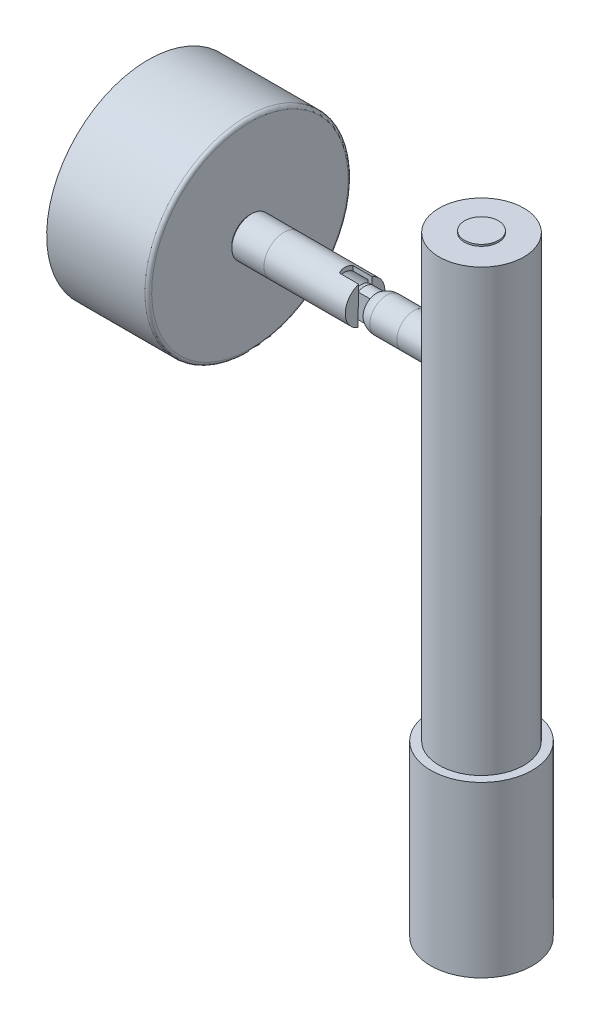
ISO-10303-21;
HEADER;
FILE_DESCRIPTION(('STEP AP214'),'2;1');
FILE_NAME('part.step','',(''),(''),'','','');
FILE_SCHEMA(('AUTOMOTIVE_DESIGN { 1 0 10303 214 1 1 1 1 }'));
ENDSEC;
DATA;
#1=APPLICATION_CONTEXT('core data for automotive mechanical design processes');
#2=APPLICATION_PROTOCOL_DEFINITION('international standard','automotive_design',2000,#1);
#3=PRODUCT_CONTEXT('',#1,'mechanical');
#4=PRODUCT('Part','Part','',(#3));
#5=PRODUCT_RELATED_PRODUCT_CATEGORY('part','',(#4));
#6=PRODUCT_DEFINITION_FORMATION('','',#4);
#7=PRODUCT_DEFINITION_CONTEXT('part definition',#1,'design');
#8=PRODUCT_DEFINITION('design','',#6,#7);
#9=PRODUCT_DEFINITION_SHAPE('','',#8);
#10=(LENGTH_UNIT() NAMED_UNIT(*) SI_UNIT(.MILLI.,.METRE.));
#11=(NAMED_UNIT(*) PLANE_ANGLE_UNIT() SI_UNIT($,.RADIAN.));
#12=(NAMED_UNIT(*) SI_UNIT($,.STERADIAN.) SOLID_ANGLE_UNIT());
#13=UNCERTAINTY_MEASURE_WITH_UNIT(LENGTH_MEASURE(1.E-05),#10,'distance_accuracy_value','');
#14=(GEOMETRIC_REPRESENTATION_CONTEXT(3) GLOBAL_UNCERTAINTY_ASSIGNED_CONTEXT((#13)) GLOBAL_UNIT_ASSIGNED_CONTEXT((#10,
#11,#12)) REPRESENTATION_CONTEXT('',''));
#15=CARTESIAN_POINT('',(0.,0.,0.));
#16=DIRECTION('',(0.,0.,1.));
#17=DIRECTION('',(1.,0.,0.));
#18=AXIS2_PLACEMENT_3D('',#15,#16,#17);
#19=CARTESIAN_POINT('',(-176.783102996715,-292.612360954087,-6.));
#20=DIRECTION('',(0.,1.,0.));
#21=DIRECTION('',(0.,0.,-1.));
#22=AXIS2_PLACEMENT_3D('',#19,#20,#21);
#23=CYLINDRICAL_SURFACE('',#22,11.);
#24=CARTESIAN_POINT('',(-176.783102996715,-292.612360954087,-6.));
#25=DIRECTION('',(0.,-1.,0.));
#26=DIRECTION('',(0.,0.,1.));
#27=AXIS2_PLACEMENT_3D('',#24,#25,#26);
#28=CIRCLE('',#27,11.);
#29=CARTESIAN_POINT('',(-176.783102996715,-292.612360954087,-17.));
#30=VERTEX_POINT('',#29);
#31=EDGE_CURVE('P0_E9',#30,#30,#28,.T.);
#32=CARTESIAN_POINT('',(-176.783102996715,-289.612360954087,-6.));
#33=DIRECTION('',(0.,-1.,0.));
#34=DIRECTION('',(0.,0.,1.));
#35=AXIS2_PLACEMENT_3D('',#32,#33,#34);
#36=CIRCLE('',#35,11.);
#37=CARTESIAN_POINT('',(-176.783102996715,-289.612360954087,-17.));
#38=VERTEX_POINT('',#37);
#39=EDGE_CURVE('P0_E17',#38,#38,#36,.T.);
#40=CARTESIAN_POINT('',(-176.783102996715,-292.612360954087,-17.));
#41=CARTESIAN_POINT('',(-176.783102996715,-292.581110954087,-17.));
#42=CARTESIAN_POINT('',(-176.783102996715,-292.549860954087,-17.));
#43=CARTESIAN_POINT('',(-176.783102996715,-292.487360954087,-17.));
#44=CARTESIAN_POINT('',(-176.783102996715,-292.456110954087,-17.));
#45=CARTESIAN_POINT('',(-176.783102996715,-292.393610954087,-17.));
#46=CARTESIAN_POINT('',(-176.783102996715,-292.362360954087,-17.));
#47=CARTESIAN_POINT('',(-176.783102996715,-292.299860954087,-17.));
#48=CARTESIAN_POINT('',(-176.783102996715,-292.268610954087,-17.));
#49=CARTESIAN_POINT('',(-176.783102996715,-292.206110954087,-17.));
#50=CARTESIAN_POINT('',(-176.783102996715,-292.174860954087,-17.));
#51=CARTESIAN_POINT('',(-176.783102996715,-292.112360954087,-17.));
#52=CARTESIAN_POINT('',(-176.783102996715,-292.081110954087,-17.));
#53=CARTESIAN_POINT('',(-176.783102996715,-292.018610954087,-17.));
#54=CARTESIAN_POINT('',(-176.783102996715,-291.987360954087,-17.));
#55=CARTESIAN_POINT('',(-176.783102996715,-291.924860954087,-17.));
#56=CARTESIAN_POINT('',(-176.783102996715,-291.893610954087,-17.));
#57=CARTESIAN_POINT('',(-176.783102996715,-291.831110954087,-17.));
#58=CARTESIAN_POINT('',(-176.783102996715,-291.799860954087,-17.));
#59=CARTESIAN_POINT('',(-176.783102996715,-291.737360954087,-17.));
#60=CARTESIAN_POINT('',(-176.783102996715,-291.706110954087,-17.));
#61=CARTESIAN_POINT('',(-176.783102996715,-291.643610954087,-17.));
#62=CARTESIAN_POINT('',(-176.783102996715,-291.612360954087,-17.));
#63=CARTESIAN_POINT('',(-176.783102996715,-291.549860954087,-17.));
#64=CARTESIAN_POINT('',(-176.783102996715,-291.518610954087,-17.));
#65=CARTESIAN_POINT('',(-176.783102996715,-291.456110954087,-17.));
#66=CARTESIAN_POINT('',(-176.783102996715,-291.424860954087,-17.));
#67=CARTESIAN_POINT('',(-176.783102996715,-291.362360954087,-17.));
#68=CARTESIAN_POINT('',(-176.783102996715,-291.331110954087,-17.));
#69=CARTESIAN_POINT('',(-176.783102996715,-291.268610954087,-17.));
#70=CARTESIAN_POINT('',(-176.783102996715,-291.237360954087,-17.));
#71=CARTESIAN_POINT('',(-176.783102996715,-291.174860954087,-17.));
#72=CARTESIAN_POINT('',(-176.783102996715,-291.143610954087,-17.));
#73=CARTESIAN_POINT('',(-176.783102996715,-291.081110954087,-17.));
#74=CARTESIAN_POINT('',(-176.783102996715,-291.049860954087,-17.));
#75=CARTESIAN_POINT('',(-176.783102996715,-290.987360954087,-17.));
#76=CARTESIAN_POINT('',(-176.783102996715,-290.956110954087,-17.));
#77=CARTESIAN_POINT('',(-176.783102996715,-290.893610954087,-17.));
#78=CARTESIAN_POINT('',(-176.783102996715,-290.862360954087,-17.));
#79=CARTESIAN_POINT('',(-176.783102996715,-290.799860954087,-17.));
#80=CARTESIAN_POINT('',(-176.783102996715,-290.768610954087,-17.));
#81=CARTESIAN_POINT('',(-176.783102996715,-290.706110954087,-17.));
#82=CARTESIAN_POINT('',(-176.783102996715,-290.674860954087,-17.));
#83=CARTESIAN_POINT('',(-176.783102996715,-290.612360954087,-17.));
#84=CARTESIAN_POINT('',(-176.783102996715,-290.581110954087,-17.));
#85=CARTESIAN_POINT('',(-176.783102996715,-290.518610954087,-17.));
#86=CARTESIAN_POINT('',(-176.783102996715,-290.487360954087,-17.));
#87=CARTESIAN_POINT('',(-176.783102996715,-290.424860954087,-17.));
#88=CARTESIAN_POINT('',(-176.783102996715,-290.393610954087,-17.));
#89=CARTESIAN_POINT('',(-176.783102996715,-290.331110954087,-17.));
#90=CARTESIAN_POINT('',(-176.783102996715,-290.299860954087,-17.));
#91=CARTESIAN_POINT('',(-176.783102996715,-290.237360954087,-17.));
#92=CARTESIAN_POINT('',(-176.783102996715,-290.206110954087,-17.));
#93=CARTESIAN_POINT('',(-176.783102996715,-290.143610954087,-17.));
#94=CARTESIAN_POINT('',(-176.783102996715,-290.112360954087,-17.));
#95=CARTESIAN_POINT('',(-176.783102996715,-290.049860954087,-17.));
#96=CARTESIAN_POINT('',(-176.783102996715,-290.018610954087,-17.));
#97=CARTESIAN_POINT('',(-176.783102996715,-289.956110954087,-17.));
#98=CARTESIAN_POINT('',(-176.783102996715,-289.924860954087,-17.));
#99=CARTESIAN_POINT('',(-176.783102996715,-289.862360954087,-17.));
#100=CARTESIAN_POINT('',(-176.783102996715,-289.831110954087,-17.));
#101=CARTESIAN_POINT('',(-176.783102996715,-289.768610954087,-17.));
#102=CARTESIAN_POINT('',(-176.783102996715,-289.737360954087,-17.));
#103=CARTESIAN_POINT('',(-176.783102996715,-289.674860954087,-17.));
#104=CARTESIAN_POINT('',(-176.783102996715,-289.643610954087,-17.));
#105=CARTESIAN_POINT('',(-176.783102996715,-289.612360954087,-17.));
#106=B_SPLINE_CURVE_WITH_KNOTS('',3,(#40,#41,#42,#43,#44,#45,#46,#47,#48,#49,#50,#51,#52,#53,
#54,#55,#56,#57,#58,#59,#60,#61,#62,#63,#64,#65,#66,#67,#68,#69,#70,#71,#72,#73,#74,#75,#76,#77,
#78,#79,#80,#81,#82,#83,#84,#85,#86,#87,#88,#89,#90,#91,#92,#93,#94,#95,#96,#97,#98,#99,#100,
#101,#102,#103,#104,#105),.UNSPECIFIED.,.F.,.F.,(4,2,2,2,2,2,2,2,2,2,2,2,2,2,2,2,2,2,2,2,2,2,2,
2,2,2,2,2,2,2,2,2,4),(0.,0.093749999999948,0.187499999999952,0.281249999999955,
0.374999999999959,0.468749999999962,0.562499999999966,0.656249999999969,0.749999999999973,
0.843749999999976,0.93749999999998,1.03124999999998,1.12499999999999,1.21874999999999,
1.31249999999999,1.40625,1.49999999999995,1.59374999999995,1.68749999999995,1.78124999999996,
1.87499999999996,1.96874999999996,2.06249999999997,2.15624999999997,2.24999999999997,
2.34374999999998,2.43749999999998,2.53124999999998,2.62499999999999,2.71874999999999,2.8125,
2.90625,2.99999999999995),.UNSPECIFIED.);
#107=EDGE_CURVE('P0_BSEAM14',#30,#38,#106,.T.);
#108=ORIENTED_EDGE('',*,*,#31,.F.);
#109=ORIENTED_EDGE('',*,*,#39,.T.);
#110=ORIENTED_EDGE('',*,*,#107,.T.);
#111=ORIENTED_EDGE('',*,*,#107,.F.);
#112=EDGE_LOOP('',(#108,#110,#109,#111));
#113=FACE_BOUND('',#112,.T.);
#114=ADVANCED_FACE('P0_F14',(#113),#23,.T.);
#115=CARTESIAN_POINT('',(-176.783102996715,-292.612360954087,-6.));
#116=DIRECTION('',(0.,-1.,0.));
#117=DIRECTION('',(0.,0.,1.));
#118=AXIS2_PLACEMENT_3D('',#115,#116,#117);
#119=PLANE('',#118);
#120=ORIENTED_EDGE('',*,*,#31,.T.);
#121=EDGE_LOOP('',(#120));
#122=FACE_BOUND('',#121,.T.);
#123=ADVANCED_FACE('P0_F29',(#122),#119,.T.);
#124=CARTESIAN_POINT('',(-176.783102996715,-289.612360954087,-6.));
#125=DIRECTION('',(0.,-1.,0.));
#126=DIRECTION('',(0.,0.,1.));
#127=AXIS2_PLACEMENT_3D('',#124,#125,#126);
#128=PLANE('',#127);
#129=ORIENTED_EDGE('',*,*,#39,.F.);
#130=EDGE_LOOP('',(#129));
#131=FACE_BOUND('',#130,.T.);
#132=ADVANCED_FACE('P0_F27',(#131),#128,.F.);
#133=CLOSED_SHELL('',(#114,#123,#132));
#134=MANIFOLD_SOLID_BREP('P0_B1',#133);
#135=CARTESIAN_POINT('',(-176.783102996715,-292.612360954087,-6.));
#136=DIRECTION('',(0.,1.,0.));
#137=DIRECTION('',(0.,0.,-1.));
#138=AXIS2_PLACEMENT_3D('',#135,#136,#137);
#139=CYLINDRICAL_SURFACE('',#138,15.);
#140=CARTESIAN_POINT('',(-176.783102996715,-292.612360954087,-6.));
#141=DIRECTION('',(0.,-1.,0.));
#142=DIRECTION('',(0.,0.,1.));
#143=AXIS2_PLACEMENT_3D('',#140,#141,#142);
#144=CIRCLE('',#143,15.);
#145=CARTESIAN_POINT('',(-176.783102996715,-292.612360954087,-21.));
#146=VERTEX_POINT('',#145);
#147=EDGE_CURVE('P1_E10',#146,#146,#144,.T.);
#148=CARTESIAN_POINT('',(-176.783102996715,-242.612360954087,-6.));
#149=DIRECTION('',(0.,-1.,0.));
#150=DIRECTION('',(0.,0.,1.));
#151=AXIS2_PLACEMENT_3D('',#148,#149,#150);
#152=CIRCLE('',#151,15.);
#153=CARTESIAN_POINT('',(-176.783102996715,-242.612360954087,-21.));
#154=VERTEX_POINT('',#153);
#155=EDGE_CURVE('P1_E18',#154,#154,#152,.T.);
#156=CARTESIAN_POINT('',(-176.783102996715,-292.612360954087,-21.));
#157=CARTESIAN_POINT('',(-176.783102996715,-292.091527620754,-21.));
#158=CARTESIAN_POINT('',(-176.783102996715,-291.57069428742,-21.));
#159=CARTESIAN_POINT('',(-176.783102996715,-290.529027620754,-21.));
#160=CARTESIAN_POINT('',(-176.783102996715,-290.00819428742,-21.));
#161=CARTESIAN_POINT('',(-176.783102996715,-288.966527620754,-21.));
#162=CARTESIAN_POINT('',(-176.783102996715,-288.44569428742,-21.));
#163=CARTESIAN_POINT('',(-176.783102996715,-287.404027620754,-21.));
#164=CARTESIAN_POINT('',(-176.783102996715,-286.88319428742,-21.));
#165=CARTESIAN_POINT('',(-176.783102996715,-285.841527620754,-21.));
#166=CARTESIAN_POINT('',(-176.783102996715,-285.32069428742,-21.));
#167=CARTESIAN_POINT('',(-176.783102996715,-284.279027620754,-21.));
#168=CARTESIAN_POINT('',(-176.783102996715,-283.75819428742,-21.));
#169=CARTESIAN_POINT('',(-176.783102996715,-282.716527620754,-21.));
#170=CARTESIAN_POINT('',(-176.783102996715,-282.19569428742,-21.));
#171=CARTESIAN_POINT('',(-176.783102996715,-281.154027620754,-21.));
#172=CARTESIAN_POINT('',(-176.783102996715,-280.63319428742,-21.));
#173=CARTESIAN_POINT('',(-176.783102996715,-279.591527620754,-21.));
#174=CARTESIAN_POINT('',(-176.783102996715,-279.07069428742,-21.));
#175=CARTESIAN_POINT('',(-176.783102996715,-278.029027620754,-21.));
#176=CARTESIAN_POINT('',(-176.783102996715,-277.50819428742,-21.));
#177=CARTESIAN_POINT('',(-176.783102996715,-276.466527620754,-21.));
#178=CARTESIAN_POINT('',(-176.783102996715,-275.94569428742,-21.));
#179=CARTESIAN_POINT('',(-176.783102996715,-274.904027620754,-21.));
#180=CARTESIAN_POINT('',(-176.783102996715,-274.38319428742,-21.));
#181=CARTESIAN_POINT('',(-176.783102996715,-273.341527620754,-21.));
#182=CARTESIAN_POINT('',(-176.783102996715,-272.82069428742,-21.));
#183=CARTESIAN_POINT('',(-176.783102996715,-271.779027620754,-21.));
#184=CARTESIAN_POINT('',(-176.783102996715,-271.25819428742,-21.));
#185=CARTESIAN_POINT('',(-176.783102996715,-270.216527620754,-21.));
#186=CARTESIAN_POINT('',(-176.783102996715,-269.69569428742,-21.));
#187=CARTESIAN_POINT('',(-176.783102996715,-268.654027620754,-21.));
#188=CARTESIAN_POINT('',(-176.783102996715,-268.13319428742,-21.));
#189=CARTESIAN_POINT('',(-176.783102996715,-267.091527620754,-21.));
#190=CARTESIAN_POINT('',(-176.783102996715,-266.57069428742,-21.));
#191=CARTESIAN_POINT('',(-176.783102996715,-265.529027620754,-21.));
#192=CARTESIAN_POINT('',(-176.783102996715,-265.00819428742,-21.));
#193=CARTESIAN_POINT('',(-176.783102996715,-263.966527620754,-21.));
#194=CARTESIAN_POINT('',(-176.783102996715,-263.44569428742,-21.));
#195=CARTESIAN_POINT('',(-176.783102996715,-262.404027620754,-21.));
#196=CARTESIAN_POINT('',(-176.783102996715,-261.88319428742,-21.));
#197=CARTESIAN_POINT('',(-176.783102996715,-260.841527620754,-21.));
#198=CARTESIAN_POINT('',(-176.783102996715,-260.32069428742,-21.));
#199=CARTESIAN_POINT('',(-176.783102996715,-259.279027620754,-21.));
#200=CARTESIAN_POINT('',(-176.783102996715,-258.75819428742,-21.));
#201=CARTESIAN_POINT('',(-176.783102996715,-257.716527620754,-21.));
#202=CARTESIAN_POINT('',(-176.783102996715,-257.19569428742,-21.));
#203=CARTESIAN_POINT('',(-176.783102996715,-256.154027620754,-21.));
#204=CARTESIAN_POINT('',(-176.783102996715,-255.63319428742,-21.));
#205=CARTESIAN_POINT('',(-176.783102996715,-254.591527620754,-21.));
#206=CARTESIAN_POINT('',(-176.783102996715,-254.07069428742,-21.));
#207=CARTESIAN_POINT('',(-176.783102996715,-253.029027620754,-21.));
#208=CARTESIAN_POINT('',(-176.783102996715,-252.50819428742,-21.));
#209=CARTESIAN_POINT('',(-176.783102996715,-251.466527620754,-21.));
#210=CARTESIAN_POINT('',(-176.783102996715,-250.94569428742,-21.));
#211=CARTESIAN_POINT('',(-176.783102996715,-249.904027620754,-21.));
#212=CARTESIAN_POINT('',(-176.783102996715,-249.38319428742,-21.));
#213=CARTESIAN_POINT('',(-176.783102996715,-248.341527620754,-21.));
#214=CARTESIAN_POINT('',(-176.783102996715,-247.82069428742,-21.));
#215=CARTESIAN_POINT('',(-176.783102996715,-246.779027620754,-21.));
#216=CARTESIAN_POINT('',(-176.783102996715,-246.25819428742,-21.));
#217=CARTESIAN_POINT('',(-176.783102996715,-245.216527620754,-21.));
#218=CARTESIAN_POINT('',(-176.783102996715,-244.69569428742,-21.));
#219=CARTESIAN_POINT('',(-176.783102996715,-243.654027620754,-21.));
#220=CARTESIAN_POINT('',(-176.783102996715,-243.13319428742,-21.));
#221=CARTESIAN_POINT('',(-176.783102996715,-242.612360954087,-21.));
#222=B_SPLINE_CURVE_WITH_KNOTS('',3,(#156,#157,#158,#159,#160,#161,#162,#163,#164,#165,#166,
#167,#168,#169,#170,#171,#172,#173,#174,#175,#176,#177,#178,#179,#180,#181,#182,#183,#184,#185,
#186,#187,#188,#189,#190,#191,#192,#193,#194,#195,#196,#197,#198,#199,#200,#201,#202,#203,#204,
#205,#206,#207,#208,#209,#210,#211,#212,#213,#214,#215,#216,#217,#218,#219,#220,#221),
.UNSPECIFIED.,.F.,.F.,(4,2,2,2,2,2,2,2,2,2,2,2,2,2,2,2,2,2,2,2,2,2,2,2,2,2,2,2,2,2,2,2,4),(0.,
1.56250000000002,3.12500000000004,4.68750000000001,6.25000000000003,7.8125,9.37500000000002,
10.9375,12.5,14.0625,15.625,17.1875,18.75,20.3125,21.875,23.4375,25.,26.5625,28.125,29.6875,
31.25,32.8125,34.375,35.9375,37.5,39.0625,40.625,42.1875,43.75,45.3125,46.875,48.4375,50.),.UNSPECIFIED.);
#223=EDGE_CURVE('P1_BSEAM15',#146,#154,#222,.T.);
#224=ORIENTED_EDGE('',*,*,#147,.F.);
#225=ORIENTED_EDGE('',*,*,#155,.T.);
#226=ORIENTED_EDGE('',*,*,#223,.T.);
#227=ORIENTED_EDGE('',*,*,#223,.F.);
#228=EDGE_LOOP('',(#224,#226,#225,#227));
#229=FACE_BOUND('',#228,.T.);
#230=ADVANCED_FACE('P1_F15',(#229),#139,.T.);
#231=CARTESIAN_POINT('',(-176.783102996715,-292.612360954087,-6.));
#232=DIRECTION('',(0.,-1.,0.));
#233=DIRECTION('',(0.,0.,1.));
#234=AXIS2_PLACEMENT_3D('',#231,#232,#233);
#235=PLANE('',#234);
#236=CARTESIAN_POINT('',(-176.783102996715,-292.612360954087,-6.));
#237=DIRECTION('',(0.,-1.,0.));
#238=DIRECTION('',(0.,0.,1.));
#239=AXIS2_PLACEMENT_3D('',#236,#237,#238);
#240=CIRCLE('',#239,11.);
#241=CARTESIAN_POINT('',(-176.783102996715,-292.612360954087,4.99999999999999));
#242=VERTEX_POINT('',#241);
#243=EDGE_CURVE('P1_E27',#242,#242,#240,.T.);
#244=ORIENTED_EDGE('',*,*,#243,.F.);
#245=EDGE_LOOP('',(#244));
#246=FACE_BOUND('',#245,.T.);
#247=ORIENTED_EDGE('',*,*,#147,.T.);
#248=EDGE_LOOP('',(#247));
#249=FACE_BOUND('',#248,.T.);
#250=ADVANCED_FACE('P1_F42',(#246,#249),#235,.T.);
#251=CARTESIAN_POINT('',(-176.783102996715,-242.612360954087,-6.));
#252=DIRECTION('',(0.,-1.,0.));
#253=DIRECTION('',(0.,0.,1.));
#254=AXIS2_PLACEMENT_3D('',#251,#252,#253);
#255=PLANE('',#254);
#256=ORIENTED_EDGE('',*,*,#155,.F.);
#257=EDGE_LOOP('',(#256));
#258=FACE_BOUND('',#257,.T.);
#259=ADVANCED_FACE('P1_F38',(#258),#255,.F.);
#260=CARTESIAN_POINT('',(-176.783102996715,-289.612360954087,-6.));
#261=DIRECTION('',(0.,-1.,0.));
#262=DIRECTION('',(0.,0.,1.));
#263=AXIS2_PLACEMENT_3D('',#260,#261,#262);
#264=CYLINDRICAL_SURFACE('',#263,11.);
#265=CARTESIAN_POINT('',(-176.783102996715,-289.612360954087,-6.));
#266=DIRECTION('',(0.,-1.,0.));
#267=DIRECTION('',(0.,0.,1.));
#268=AXIS2_PLACEMENT_3D('',#265,#266,#267);
#269=CIRCLE('',#268,11.);
#270=CARTESIAN_POINT('',(-176.783102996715,-289.612360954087,4.99999999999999));
#271=VERTEX_POINT('',#270);
#272=EDGE_CURVE('P1_E25',#271,#271,#269,.T.);
#273=CARTESIAN_POINT('',(-176.783102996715,-289.612360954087,4.99999999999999));
#274=CARTESIAN_POINT('',(-176.783102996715,-289.643610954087,4.99999999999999));
#275=CARTESIAN_POINT('',(-176.783102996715,-289.674860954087,4.99999999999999));
#276=CARTESIAN_POINT('',(-176.783102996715,-289.737360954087,4.99999999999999));
#277=CARTESIAN_POINT('',(-176.783102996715,-289.768610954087,4.99999999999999));
#278=CARTESIAN_POINT('',(-176.783102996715,-289.831110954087,4.99999999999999));
#279=CARTESIAN_POINT('',(-176.783102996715,-289.862360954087,4.99999999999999));
#280=CARTESIAN_POINT('',(-176.783102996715,-289.924860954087,4.99999999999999));
#281=CARTESIAN_POINT('',(-176.783102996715,-289.956110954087,4.99999999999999));
#282=CARTESIAN_POINT('',(-176.783102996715,-290.018610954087,4.99999999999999));
#283=CARTESIAN_POINT('',(-176.783102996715,-290.049860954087,4.99999999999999));
#284=CARTESIAN_POINT('',(-176.783102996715,-290.112360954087,4.99999999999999));
#285=CARTESIAN_POINT('',(-176.783102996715,-290.143610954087,4.99999999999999));
#286=CARTESIAN_POINT('',(-176.783102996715,-290.206110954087,4.99999999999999));
#287=CARTESIAN_POINT('',(-176.783102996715,-290.237360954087,4.99999999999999));
#288=CARTESIAN_POINT('',(-176.783102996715,-290.299860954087,4.99999999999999));
#289=CARTESIAN_POINT('',(-176.783102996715,-290.331110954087,4.99999999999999));
#290=CARTESIAN_POINT('',(-176.783102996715,-290.393610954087,4.99999999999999));
#291=CARTESIAN_POINT('',(-176.783102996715,-290.424860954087,4.99999999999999));
#292=CARTESIAN_POINT('',(-176.783102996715,-290.487360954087,4.99999999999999));
#293=CARTESIAN_POINT('',(-176.783102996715,-290.518610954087,4.99999999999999));
#294=CARTESIAN_POINT('',(-176.783102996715,-290.581110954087,4.99999999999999));
#295=CARTESIAN_POINT('',(-176.783102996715,-290.612360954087,4.99999999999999));
#296=CARTESIAN_POINT('',(-176.783102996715,-290.674860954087,4.99999999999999));
#297=CARTESIAN_POINT('',(-176.783102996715,-290.706110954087,4.99999999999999));
#298=CARTESIAN_POINT('',(-176.783102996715,-290.768610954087,4.99999999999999));
#299=CARTESIAN_POINT('',(-176.783102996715,-290.799860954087,4.99999999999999));
#300=CARTESIAN_POINT('',(-176.783102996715,-290.862360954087,4.99999999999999));
#301=CARTESIAN_POINT('',(-176.783102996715,-290.893610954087,4.99999999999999));
#302=CARTESIAN_POINT('',(-176.783102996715,-290.956110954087,4.99999999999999));
#303=CARTESIAN_POINT('',(-176.783102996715,-290.987360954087,4.99999999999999));
#304=CARTESIAN_POINT('',(-176.783102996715,-291.049860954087,4.99999999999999));
#305=CARTESIAN_POINT('',(-176.783102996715,-291.081110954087,4.99999999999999));
#306=CARTESIAN_POINT('',(-176.783102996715,-291.143610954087,4.99999999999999));
#307=CARTESIAN_POINT('',(-176.783102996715,-291.174860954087,4.99999999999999));
#308=CARTESIAN_POINT('',(-176.783102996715,-291.237360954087,4.99999999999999));
#309=CARTESIAN_POINT('',(-176.783102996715,-291.268610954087,4.99999999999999));
#310=CARTESIAN_POINT('',(-176.783102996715,-291.331110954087,4.99999999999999));
#311=CARTESIAN_POINT('',(-176.783102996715,-291.362360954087,4.99999999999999));
#312=CARTESIAN_POINT('',(-176.783102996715,-291.424860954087,4.99999999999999));
#313=CARTESIAN_POINT('',(-176.783102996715,-291.456110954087,4.99999999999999));
#314=CARTESIAN_POINT('',(-176.783102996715,-291.518610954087,4.99999999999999));
#315=CARTESIAN_POINT('',(-176.783102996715,-291.549860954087,4.99999999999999));
#316=CARTESIAN_POINT('',(-176.783102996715,-291.612360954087,4.99999999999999));
#317=CARTESIAN_POINT('',(-176.783102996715,-291.643610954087,4.99999999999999));
#318=CARTESIAN_POINT('',(-176.783102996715,-291.706110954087,4.99999999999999));
#319=CARTESIAN_POINT('',(-176.783102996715,-291.737360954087,4.99999999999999));
#320=CARTESIAN_POINT('',(-176.783102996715,-291.799860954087,4.99999999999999));
#321=CARTESIAN_POINT('',(-176.783102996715,-291.831110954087,4.99999999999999));
#322=CARTESIAN_POINT('',(-176.783102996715,-291.893610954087,4.99999999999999));
#323=CARTESIAN_POINT('',(-176.783102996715,-291.924860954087,4.99999999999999));
#324=CARTESIAN_POINT('',(-176.783102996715,-291.987360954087,4.99999999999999));
#325=CARTESIAN_POINT('',(-176.783102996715,-292.018610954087,4.99999999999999));
#326=CARTESIAN_POINT('',(-176.783102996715,-292.081110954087,4.99999999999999));
#327=CARTESIAN_POINT('',(-176.783102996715,-292.112360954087,4.99999999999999));
#328=CARTESIAN_POINT('',(-176.783102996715,-292.174860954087,4.99999999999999));
#329=CARTESIAN_POINT('',(-176.783102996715,-292.206110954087,4.99999999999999));
#330=CARTESIAN_POINT('',(-176.783102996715,-292.268610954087,4.99999999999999));
#331=CARTESIAN_POINT('',(-176.783102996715,-292.299860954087,4.99999999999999));
#332=CARTESIAN_POINT('',(-176.783102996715,-292.362360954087,4.99999999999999));
#333=CARTESIAN_POINT('',(-176.783102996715,-292.393610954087,4.99999999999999));
#334=CARTESIAN_POINT('',(-176.783102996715,-292.456110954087,4.99999999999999));
#335=CARTESIAN_POINT('',(-176.783102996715,-292.487360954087,4.99999999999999));
#336=CARTESIAN_POINT('',(-176.783102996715,-292.549860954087,4.99999999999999));
#337=CARTESIAN_POINT('',(-176.783102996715,-292.581110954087,4.99999999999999));
#338=CARTESIAN_POINT('',(-176.783102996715,-292.612360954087,4.99999999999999));
#339=B_SPLINE_CURVE_WITH_KNOTS('',3,(#273,#274,#275,#276,#277,#278,#279,#280,#281,#282,#283,
#284,#285,#286,#287,#288,#289,#290,#291,#292,#293,#294,#295,#296,#297,#298,#299,#300,#301,#302,
#303,#304,#305,#306,#307,#308,#309,#310,#311,#312,#313,#314,#315,#316,#317,#318,#319,#320,#321,
#322,#323,#324,#325,#326,#327,#328,#329,#330,#331,#332,#333,#334,#335,#336,#337,#338),
.UNSPECIFIED.,.F.,.F.,(4,2,2,2,2,2,2,2,2,2,2,2,2,2,2,2,2,2,2,2,2,2,2,2,2,2,2,2,2,2,2,2,4),(0.,
0.0937500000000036,0.187500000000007,0.281250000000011,0.375000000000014,0.468750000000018,
0.562500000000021,0.656250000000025,0.750000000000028,0.843750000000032,0.937500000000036,
1.03125000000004,1.12500000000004,1.21875000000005,1.31250000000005,1.40625000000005,
1.50000000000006,1.59375,1.68750000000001,1.78125000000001,1.87500000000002,1.96875000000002,
2.06250000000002,2.15625000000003,2.25000000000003,2.34375000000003,2.43750000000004,
2.53125000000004,2.62500000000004,2.71875000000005,2.81250000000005,2.90625000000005,
3.00000000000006),.UNSPECIFIED.);
#340=EDGE_CURVE('P1_BSEAM35',#271,#242,#339,.T.);
#341=ORIENTED_EDGE('',*,*,#272,.F.);
#342=ORIENTED_EDGE('',*,*,#243,.T.);
#343=ORIENTED_EDGE('',*,*,#340,.T.);
#344=ORIENTED_EDGE('',*,*,#340,.F.);
#345=EDGE_LOOP('',(#341,#343,#342,#344));
#346=FACE_BOUND('',#345,.T.);
#347=ADVANCED_FACE('P1_F35',(#346),#264,.F.);
#348=CARTESIAN_POINT('',(-176.783102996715,-289.612360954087,-6.));
#349=DIRECTION('',(0.,-1.,0.));
#350=DIRECTION('',(0.,0.,1.));
#351=AXIS2_PLACEMENT_3D('',#348,#349,#350);
#352=PLANE('',#351);
#353=ORIENTED_EDGE('',*,*,#272,.T.);
#354=EDGE_LOOP('',(#353));
#355=FACE_BOUND('',#354,.T.);
#356=ADVANCED_FACE('P1_F33',(#355),#352,.T.);
#357=CLOSED_SHELL('',(#230,#250,#259,#347,#356));
#358=MANIFOLD_SOLID_BREP('P1_B1',#357);
#359=CARTESIAN_POINT('',(-176.783102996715,-112.112360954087,-6.));
#360=DIRECTION('',(0.,-1.,0.));
#361=DIRECTION('',(0.,0.,1.));
#362=AXIS2_PLACEMENT_3D('',#359,#360,#361);
#363=CYLINDRICAL_SURFACE('',#362,5.);
#364=CARTESIAN_POINT('',(-176.783102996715,-112.112360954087,-6.));
#365=DIRECTION('',(0.,1.,0.));
#366=DIRECTION('',(0.,0.,-1.));
#367=AXIS2_PLACEMENT_3D('',#364,#365,#366);
#368=CIRCLE('',#367,5.);
#369=CARTESIAN_POINT('',(-176.783102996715,-112.112360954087,-1.));
#370=VERTEX_POINT('',#369);
#371=EDGE_CURVE('P2_E10',#370,#370,#368,.T.);
#372=CARTESIAN_POINT('',(-176.783102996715,-113.612360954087,-6.));
#373=DIRECTION('',(0.,1.,0.));
#374=DIRECTION('',(0.,0.,-1.));
#375=AXIS2_PLACEMENT_3D('',#372,#373,#374);
#376=CIRCLE('',#375,5.);
#377=CARTESIAN_POINT('',(-176.783102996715,-113.612360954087,-1.));
#378=VERTEX_POINT('',#377);
#379=EDGE_CURVE('P2_E18',#378,#378,#376,.T.);
#380=CARTESIAN_POINT('',(-176.783102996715,-112.112360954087,-1.));
#381=CARTESIAN_POINT('',(-176.783102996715,-112.127985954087,-1.));
#382=CARTESIAN_POINT('',(-176.783102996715,-112.143610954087,-1.));
#383=CARTESIAN_POINT('',(-176.783102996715,-112.174860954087,-1.));
#384=CARTESIAN_POINT('',(-176.783102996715,-112.190485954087,-1.));
#385=CARTESIAN_POINT('',(-176.783102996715,-112.221735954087,-1.));
#386=CARTESIAN_POINT('',(-176.783102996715,-112.237360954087,-1.));
#387=CARTESIAN_POINT('',(-176.783102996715,-112.268610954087,-1.));
#388=CARTESIAN_POINT('',(-176.783102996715,-112.284235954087,-1.));
#389=CARTESIAN_POINT('',(-176.783102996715,-112.315485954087,-1.));
#390=CARTESIAN_POINT('',(-176.783102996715,-112.331110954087,-1.));
#391=CARTESIAN_POINT('',(-176.783102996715,-112.362360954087,-1.));
#392=CARTESIAN_POINT('',(-176.783102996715,-112.377985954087,-1.));
#393=CARTESIAN_POINT('',(-176.783102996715,-112.409235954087,-1.));
#394=CARTESIAN_POINT('',(-176.783102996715,-112.424860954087,-1.));
#395=CARTESIAN_POINT('',(-176.783102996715,-112.456110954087,-1.));
#396=CARTESIAN_POINT('',(-176.783102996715,-112.471735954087,-1.));
#397=CARTESIAN_POINT('',(-176.783102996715,-112.502985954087,-1.));
#398=CARTESIAN_POINT('',(-176.783102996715,-112.518610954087,-1.));
#399=CARTESIAN_POINT('',(-176.783102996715,-112.549860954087,-1.));
#400=CARTESIAN_POINT('',(-176.783102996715,-112.565485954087,-1.));
#401=CARTESIAN_POINT('',(-176.783102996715,-112.596735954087,-1.));
#402=CARTESIAN_POINT('',(-176.783102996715,-112.612360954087,-1.));
#403=CARTESIAN_POINT('',(-176.783102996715,-112.643610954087,-1.));
#404=CARTESIAN_POINT('',(-176.783102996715,-112.659235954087,-1.));
#405=CARTESIAN_POINT('',(-176.783102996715,-112.690485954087,-1.));
#406=CARTESIAN_POINT('',(-176.783102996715,-112.706110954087,-1.));
#407=CARTESIAN_POINT('',(-176.783102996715,-112.737360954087,-1.));
#408=CARTESIAN_POINT('',(-176.783102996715,-112.752985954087,-1.));
#409=CARTESIAN_POINT('',(-176.783102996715,-112.784235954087,-1.));
#410=CARTESIAN_POINT('',(-176.783102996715,-112.799860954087,-1.));
#411=CARTESIAN_POINT('',(-176.783102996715,-112.831110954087,-1.));
#412=CARTESIAN_POINT('',(-176.783102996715,-112.846735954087,-1.));
#413=CARTESIAN_POINT('',(-176.783102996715,-112.877985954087,-1.));
#414=CARTESIAN_POINT('',(-176.783102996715,-112.893610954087,-1.));
#415=CARTESIAN_POINT('',(-176.783102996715,-112.924860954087,-1.));
#416=CARTESIAN_POINT('',(-176.783102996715,-112.940485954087,-1.));
#417=CARTESIAN_POINT('',(-176.783102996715,-112.971735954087,-1.));
#418=CARTESIAN_POINT('',(-176.783102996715,-112.987360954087,-1.));
#419=CARTESIAN_POINT('',(-176.783102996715,-113.018610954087,-1.));
#420=CARTESIAN_POINT('',(-176.783102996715,-113.034235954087,-1.));
#421=CARTESIAN_POINT('',(-176.783102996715,-113.065485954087,-1.));
#422=CARTESIAN_POINT('',(-176.783102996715,-113.081110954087,-1.));
#423=CARTESIAN_POINT('',(-176.783102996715,-113.112360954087,-1.));
#424=CARTESIAN_POINT('',(-176.783102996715,-113.127985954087,-1.));
#425=CARTESIAN_POINT('',(-176.783102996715,-113.159235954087,-1.));
#426=CARTESIAN_POINT('',(-176.783102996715,-113.174860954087,-1.));
#427=CARTESIAN_POINT('',(-176.783102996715,-113.206110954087,-1.));
#428=CARTESIAN_POINT('',(-176.783102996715,-113.221735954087,-1.));
#429=CARTESIAN_POINT('',(-176.783102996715,-113.252985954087,-1.));
#430=CARTESIAN_POINT('',(-176.783102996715,-113.268610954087,-1.));
#431=CARTESIAN_POINT('',(-176.783102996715,-113.299860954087,-1.));
#432=CARTESIAN_POINT('',(-176.783102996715,-113.315485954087,-1.));
#433=CARTESIAN_POINT('',(-176.783102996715,-113.346735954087,-1.));
#434=CARTESIAN_POINT('',(-176.783102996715,-113.362360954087,-1.));
#435=CARTESIAN_POINT('',(-176.783102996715,-113.393610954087,-1.));
#436=CARTESIAN_POINT('',(-176.783102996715,-113.409235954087,-1.));
#437=CARTESIAN_POINT('',(-176.783102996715,-113.440485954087,-1.));
#438=CARTESIAN_POINT('',(-176.783102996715,-113.456110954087,-1.));
#439=CARTESIAN_POINT('',(-176.783102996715,-113.487360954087,-1.));
#440=CARTESIAN_POINT('',(-176.783102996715,-113.502985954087,-1.));
#441=CARTESIAN_POINT('',(-176.783102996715,-113.534235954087,-1.));
#442=CARTESIAN_POINT('',(-176.783102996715,-113.549860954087,-1.));
#443=CARTESIAN_POINT('',(-176.783102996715,-113.581110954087,-1.));
#444=CARTESIAN_POINT('',(-176.783102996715,-113.596735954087,-1.));
#445=CARTESIAN_POINT('',(-176.783102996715,-113.612360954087,-1.));
#446=B_SPLINE_CURVE_WITH_KNOTS('',3,(#380,#381,#382,#383,#384,#385,#386,#387,#388,#389,#390,
#391,#392,#393,#394,#395,#396,#397,#398,#399,#400,#401,#402,#403,#404,#405,#406,#407,#408,#409,
#410,#411,#412,#413,#414,#415,#416,#417,#418,#419,#420,#421,#422,#423,#424,#425,#426,#427,#428,
#429,#430,#431,#432,#433,#434,#435,#436,#437,#438,#439,#440,#441,#442,#443,#444,#445),
.UNSPECIFIED.,.F.,.F.,(4,2,2,2,2,2,2,2,2,2,2,2,2,2,2,2,2,2,2,2,2,2,2,2,2,2,2,2,2,2,2,2,4),(0.,
0.0468750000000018,0.0937500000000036,0.140625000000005,0.187500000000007,0.234375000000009,
0.281250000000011,0.328125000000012,0.375000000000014,0.421875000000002,0.468750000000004,
0.515625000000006,0.562500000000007,0.609375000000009,0.656250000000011,0.703125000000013,
0.750000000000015,0.796875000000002,0.843750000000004,0.890625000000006,0.937500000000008,
0.98437500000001,1.03125000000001,1.07812500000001,1.12500000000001,1.171875,1.21875,
1.26562500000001,1.31250000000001,1.35937500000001,1.40625000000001,1.45312500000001,
1.50000000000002),.UNSPECIFIED.);
#447=EDGE_CURVE('P2_BSEAM15',#370,#378,#446,.T.);
#448=ORIENTED_EDGE('',*,*,#371,.F.);
#449=ORIENTED_EDGE('',*,*,#379,.T.);
#450=ORIENTED_EDGE('',*,*,#447,.T.);
#451=ORIENTED_EDGE('',*,*,#447,.F.);
#452=EDGE_LOOP('',(#448,#450,#449,#451));
#453=FACE_BOUND('',#452,.T.);
#454=ADVANCED_FACE('P2_F15',(#453),#363,.T.);
#455=CARTESIAN_POINT('',(-176.783102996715,-112.112360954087,-6.));
#456=DIRECTION('',(0.,1.,0.));
#457=DIRECTION('',(0.,0.,-1.));
#458=AXIS2_PLACEMENT_3D('',#455,#456,#457);
#459=PLANE('',#458);
#460=ORIENTED_EDGE('',*,*,#371,.T.);
#461=EDGE_LOOP('',(#460));
#462=FACE_BOUND('',#461,.T.);
#463=ADVANCED_FACE('P2_F30',(#462),#459,.T.);
#464=CARTESIAN_POINT('',(-176.783102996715,-113.612360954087,-6.));
#465=DIRECTION('',(0.,1.,0.));
#466=DIRECTION('',(0.,0.,-1.));
#467=AXIS2_PLACEMENT_3D('',#464,#465,#466);
#468=PLANE('',#467);
#469=ORIENTED_EDGE('',*,*,#379,.F.);
#470=EDGE_LOOP('',(#469));
#471=FACE_BOUND('',#470,.T.);
#472=ADVANCED_FACE('P2_F28',(#471),#468,.F.);
#473=CLOSED_SHELL('',(#454,#463,#472));
#474=MANIFOLD_SOLID_BREP('P2_B1',#473);
#475=CARTESIAN_POINT('',(-176.783102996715,-112.612360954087,-6.));
#476=DIRECTION('',(0.,-1.,0.));
#477=DIRECTION('',(0.,0.,1.));
#478=AXIS2_PLACEMENT_3D('',#475,#476,#477);
#479=CYLINDRICAL_SURFACE('',#478,12.5);
#480=CARTESIAN_POINT('',(-176.783102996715,-112.612360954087,-6.));
#481=DIRECTION('',(0.,1.,0.));
#482=DIRECTION('',(0.,0.,-1.));
#483=AXIS2_PLACEMENT_3D('',#480,#481,#482);
#484=CIRCLE('',#483,12.5);
#485=CARTESIAN_POINT('',(-176.783102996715,-112.612360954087,-18.5));
#486=VERTEX_POINT('',#485);
#487=EDGE_CURVE('P3_E26',#486,#486,#484,.T.);
#488=ORIENTED_EDGE('',*,*,#487,.F.);
#489=EDGE_LOOP('',(#488));
#490=FACE_BOUND('',#489,.T.);
#491=CARTESIAN_POINT('',(-176.783102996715,-242.612360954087,-6.));
#492=DIRECTION('',(0.,1.,0.));
#493=DIRECTION('',(0.,0.,-1.));
#494=AXIS2_PLACEMENT_3D('',#491,#492,#493);
#495=CIRCLE('',#494,12.5);
#496=CARTESIAN_POINT('',(-176.783102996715,-242.612360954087,-18.5));
#497=VERTEX_POINT('',#496);
#498=EDGE_CURVE('P3_E30',#497,#497,#495,.T.);
#499=ORIENTED_EDGE('',*,*,#498,.T.);
#500=EDGE_LOOP('',(#499));
#501=FACE_BOUND('',#500,.T.);
#502=CARTESIAN_POINT('',(-188.239542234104,-147.612360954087,-11.));
#503=CARTESIAN_POINT('',(-188.239543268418,-147.74633260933,-10.9999989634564));
#504=CARTESIAN_POINT('',(-188.241900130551,-147.880345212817,-10.9946081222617));
#505=CARTESIAN_POINT('',(-188.251251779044,-148.147401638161,-10.9730972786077));
#506=CARTESIAN_POINT('',(-188.258249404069,-148.280444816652,-10.9569707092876));
#507=CARTESIAN_POINT('',(-188.276665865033,-148.544778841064,-10.9141180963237));
#508=CARTESIAN_POINT('',(-188.288093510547,-148.676065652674,-10.887370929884));
#509=CARTESIAN_POINT('',(-188.314998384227,-148.935728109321,-10.8235449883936));
#510=CARTESIAN_POINT('',(-188.330477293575,-149.064102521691,-10.786461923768));
#511=CARTESIAN_POINT('',(-188.364923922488,-149.31651418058,-10.7024963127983));
#512=CARTESIAN_POINT('',(-188.383876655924,-149.440567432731,-10.655655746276));
#513=CARTESIAN_POINT('',(-188.424750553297,-149.684172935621,-10.5524850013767));
#514=CARTESIAN_POINT('',(-188.446672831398,-149.803723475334,-10.4961512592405));
#515=CARTESIAN_POINT('',(-188.515952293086,-150.154433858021,-10.3136049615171));
#516=CARTESIAN_POINT('',(-188.566867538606,-150.377967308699,-10.1737417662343));
#517=CARTESIAN_POINT('',(-188.675628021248,-150.81054674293,-9.85329894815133));
#518=CARTESIAN_POINT('',(-188.733695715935,-151.01824016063,-9.67098388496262));
#519=CARTESIAN_POINT('',(-188.848419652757,-151.401195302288,-9.27423726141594));
#520=CARTESIAN_POINT('',(-188.905075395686,-151.576445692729,-9.05979452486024));
#521=CARTESIAN_POINT('',(-188.985650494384,-151.814505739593,-8.7134344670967));
#522=CARTESIAN_POINT('',(-189.012236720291,-151.890927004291,-8.59127330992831));
#523=CARTESIAN_POINT('',(-189.062714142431,-152.033138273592,-8.34040236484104));
#524=CARTESIAN_POINT('',(-189.086606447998,-152.098932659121,-8.21169530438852));
#525=CARTESIAN_POINT('',(-189.131013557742,-152.219315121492,-7.94856757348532));
#526=CARTESIAN_POINT('',(-189.151527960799,-152.273901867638,-7.81414622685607));
#527=CARTESIAN_POINT('',(-189.188564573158,-152.371300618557,-7.54063330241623));
#528=CARTESIAN_POINT('',(-189.205088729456,-152.414118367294,-7.40154404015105));
#529=CARTESIAN_POINT('',(-189.232969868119,-152.48578078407,-7.12649748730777));
#530=CARTESIAN_POINT('',(-189.244536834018,-152.515197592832,-6.9907104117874));
#531=CARTESIAN_POINT('',(-189.263281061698,-152.562645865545,-6.71691827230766));
#532=CARTESIAN_POINT('',(-189.270460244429,-152.580682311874,-6.57891420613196));
#533=CARTESIAN_POINT('',(-189.280230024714,-152.605186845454,-6.30173639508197));
#534=CARTESIAN_POINT('',(-189.282821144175,-152.611656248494,-6.16256278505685));
#535=CARTESIAN_POINT('',(-189.28334119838,-152.61295653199,-5.88415489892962));
#536=CARTESIAN_POINT('',(-189.281270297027,-152.607787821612,-5.74492062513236));
#537=CARTESIAN_POINT('',(-189.272774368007,-152.586491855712,-5.47534913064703));
#538=CARTESIAN_POINT('',(-189.266601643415,-152.570999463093,-5.34495322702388));
#539=CARTESIAN_POINT('',(-189.250316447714,-152.529857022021,-5.08598150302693));
#540=CARTESIAN_POINT('',(-189.240202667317,-152.504203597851,-4.95740630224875));
#541=CARTESIAN_POINT('',(-189.216291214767,-152.442988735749,-4.70302774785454));
#542=CARTESIAN_POINT('',(-189.202494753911,-152.407430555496,-4.5772234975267));
#543=CARTESIAN_POINT('',(-189.171560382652,-152.326727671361,-4.32913448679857));
#544=CARTESIAN_POINT('',(-189.154421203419,-152.281579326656,-4.2068510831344));
#545=CARTESIAN_POINT('',(-189.098035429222,-152.13081470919,-3.84290213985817));
#546=CARTESIAN_POINT('',(-189.054175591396,-152.010751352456,-3.6077466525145));
#547=CARTESIAN_POINT('',(-188.958464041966,-151.736183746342,-3.16043889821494));
#548=CARTESIAN_POINT('',(-188.906609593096,-151.581667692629,-2.94829455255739));
#549=CARTESIAN_POINT('',(-188.796146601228,-151.230752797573,-2.5380948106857));
#550=CARTESIAN_POINT('',(-188.737318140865,-151.032270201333,-2.34187887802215));
#551=CARTESIAN_POINT('',(-188.622137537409,-150.604840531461,-1.98470796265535));
#552=CARTESIAN_POINT('',(-188.565786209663,-150.375883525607,-1.82376452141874));
#553=CARTESIAN_POINT('',(-188.487195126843,-150.01038836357,-1.61021556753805));
#554=CARTESIAN_POINT('',(-188.461672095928,-149.882918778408,-1.54293709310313));
#555=CARTESIAN_POINT('',(-188.413792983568,-149.622172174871,-1.41945034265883));
#556=CARTESIAN_POINT('',(-188.391435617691,-149.488897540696,-1.36323757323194));
#557=CARTESIAN_POINT('',(-188.350662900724,-149.217489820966,-1.26243548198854));
#558=CARTESIAN_POINT('',(-188.332246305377,-149.079358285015,-1.21784249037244));
#559=CARTESIAN_POINT('',(-188.300017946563,-148.799236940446,-1.1407387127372));
#560=CARTESIAN_POINT('',(-188.28620581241,-148.657247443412,-1.10822695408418));
#561=CARTESIAN_POINT('',(-188.264403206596,-148.379340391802,-1.05728166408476));
#562=CARTESIAN_POINT('',(-188.256108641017,-148.243581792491,-1.03810943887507));
#563=CARTESIAN_POINT('',(-188.244336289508,-147.970743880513,-1.01097681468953));
#564=CARTESIAN_POINT('',(-188.240858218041,-147.833664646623,-1.0030157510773));
#565=CARTESIAN_POINT('',(-188.238844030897,-147.559314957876,-0.998399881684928));
#566=CARTESIAN_POINT('',(-188.240306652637,-147.422044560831,-1.00174218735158));
#567=CARTESIAN_POINT('',(-188.248117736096,-147.148386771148,-1.0196855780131));
#568=CARTESIAN_POINT('',(-188.254466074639,-147.011999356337,-1.03428637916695));
#569=CARTESIAN_POINT('',(-188.27132678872,-146.748929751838,-1.0734250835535));
#570=CARTESIAN_POINT('',(-188.281580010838,-146.622138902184,-1.09734633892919));
#571=CARTESIAN_POINT('',(-188.305908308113,-146.371117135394,-1.1548046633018));
#572=CARTESIAN_POINT('',(-188.319984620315,-146.246887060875,-1.18834484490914));
#573=CARTESIAN_POINT('',(-188.367348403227,-145.879278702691,-1.30295989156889));
#574=CARTESIAN_POINT('',(-188.405784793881,-145.640778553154,-1.39806001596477));
#575=CARTESIAN_POINT('',(-188.493949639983,-145.173314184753,-1.62717172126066));
#576=CARTESIAN_POINT('',(-188.544072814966,-144.945128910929,-1.76260489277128));
#577=CARTESIAN_POINT('',(-188.649360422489,-144.513670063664,-2.06707487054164));
#578=CARTESIAN_POINT('',(-188.704526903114,-144.31040669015,-2.23612536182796));
#579=CARTESIAN_POINT('',(-188.81863310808,-143.918900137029,-2.61792969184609));
#580=CARTESIAN_POINT('',(-188.877550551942,-143.73287544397,-2.83298933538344));
#581=CARTESIAN_POINT('',(-188.960846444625,-143.482760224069,-3.17747880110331));
#582=CARTESIAN_POINT('',(-188.987779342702,-143.404171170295,-3.2960346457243));
#583=CARTESIAN_POINT('',(-189.039236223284,-143.257186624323,-3.53978148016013));
#584=CARTESIAN_POINT('',(-189.063761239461,-143.188786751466,-3.66496958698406));
#585=CARTESIAN_POINT('',(-189.109726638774,-143.062734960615,-3.92122499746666));
#586=CARTESIAN_POINT('',(-189.131166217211,-143.005085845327,-4.05229382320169));
#587=CARTESIAN_POINT('',(-189.170336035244,-142.901112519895,-4.31932926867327));
#588=CARTESIAN_POINT('',(-189.188067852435,-142.854783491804,-4.45529377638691));
#589=CARTESIAN_POINT('',(-189.219309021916,-142.773909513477,-4.73112677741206));
#590=CARTESIAN_POINT('',(-189.232819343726,-142.739361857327,-4.87099436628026));
#591=CARTESIAN_POINT('',(-189.255215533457,-142.682424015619,-5.15354490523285));
#592=CARTESIAN_POINT('',(-189.264101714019,-142.660033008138,-5.29622766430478));
#593=CARTESIAN_POINT('',(-189.276556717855,-142.628730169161,-5.57381081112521));
#594=CARTESIAN_POINT('',(-189.28043556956,-142.619031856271,-5.70860915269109));
#595=CARTESIAN_POINT('',(-189.283814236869,-142.610581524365,-5.97865210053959));
#596=CARTESIAN_POINT('',(-189.283312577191,-142.611833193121,-6.11389684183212));
#597=CARTESIAN_POINT('',(-189.277941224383,-142.6252756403,-6.38368237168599));
#598=CARTESIAN_POINT('',(-189.273073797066,-142.637460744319,-6.51822348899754));
#599=CARTESIAN_POINT('',(-189.259104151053,-142.672637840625,-6.78571069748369));
#600=CARTESIAN_POINT('',(-189.250000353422,-142.695633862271,-6.9186561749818));
#601=CARTESIAN_POINT('',(-189.228145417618,-142.751320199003,-7.17783467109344));
#602=CARTESIAN_POINT('',(-189.215516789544,-142.783686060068,-7.30414775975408));
#603=CARTESIAN_POINT('',(-189.186826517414,-142.858044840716,-7.55352320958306));
#604=CARTESIAN_POINT('',(-189.170763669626,-142.900041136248,-7.67658441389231));
#605=CARTESIAN_POINT('',(-189.117986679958,-143.039953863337,-8.03966746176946));
#606=CARTESIAN_POINT('',(-189.076665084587,-143.151840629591,-8.27380285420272));
#607=CARTESIAN_POINT('',(-188.983552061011,-143.415132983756,-8.73054850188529));
#608=CARTESIAN_POINT('',(-188.931378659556,-143.568066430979,-8.95219224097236));
#609=CARTESIAN_POINT('',(-188.822840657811,-143.906817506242,-9.36761879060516));
#610=CARTESIAN_POINT('',(-188.766474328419,-144.092648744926,-9.56139000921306));
#611=CARTESIAN_POINT('',(-188.651539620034,-144.505696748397,-9.92802886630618));
#612=CARTESIAN_POINT('',(-188.593050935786,-144.734763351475,-10.0988598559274));
#613=CARTESIAN_POINT('',(-188.511511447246,-145.098480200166,-10.324448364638));
#614=CARTESIAN_POINT('',(-188.485348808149,-145.223160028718,-10.3945706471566));
#615=CARTESIAN_POINT('',(-188.43589981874,-145.478507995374,-10.5240606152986));
#616=CARTESIAN_POINT('',(-188.412612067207,-145.609173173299,-10.5834335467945));
#617=CARTESIAN_POINT('',(-188.371607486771,-145.863710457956,-10.6860795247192));
#618=CARTESIAN_POINT('',(-188.353578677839,-145.987144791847,-10.7303176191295));
#619=CARTESIAN_POINT('',(-188.3210785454,-146.237490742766,-10.8090472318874));
#620=CARTESIAN_POINT('',(-188.306605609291,-146.364400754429,-10.8435431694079));
#621=CARTESIAN_POINT('',(-188.281681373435,-146.620630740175,-10.9024194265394));
#622=CARTESIAN_POINT('',(-188.271221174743,-146.749944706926,-10.9268221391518));
#623=CARTESIAN_POINT('',(-188.254615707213,-147.010314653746,-10.9653641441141));
#624=CARTESIAN_POINT('',(-188.248467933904,-147.141369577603,-10.9795093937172));
#625=CARTESIAN_POINT('',(-188.242899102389,-147.329298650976,-10.992302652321));
#626=CARTESIAN_POINT('',(-188.241641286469,-147.385860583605,-10.9951881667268));
#627=CARTESIAN_POINT('',(-188.23996260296,-147.499066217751,-10.9990371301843));
#628=CARTESIAN_POINT('',(-188.239541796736,-147.555709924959,-11.0000004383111));
#629=CARTESIAN_POINT('',(-188.239542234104,-147.612360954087,-11.));
#630=B_SPLINE_CURVE_WITH_KNOTS('',3,(#502,#503,#504,#505,#506,#507,#508,#509,#510,#511,#512,
#513,#514,#515,#516,#517,#518,#519,#520,#521,#522,#523,#524,#525,#526,#527,#528,#529,#530,#531,
#532,#533,#534,#535,#536,#537,#538,#539,#540,#541,#542,#543,#544,#545,#546,#547,#548,#549,#550,
#551,#552,#553,#554,#555,#556,#557,#558,#559,#560,#561,#562,#563,#564,#565,#566,#567,#568,#569,
#570,#571,#572,#573,#574,#575,#576,#577,#578,#579,#580,#581,#582,#583,#584,#585,#586,#587,#588,
#589,#590,#591,#592,#593,#594,#595,#596,#597,#598,#599,#600,#601,#602,#603,#604,#605,#606,#607,
#608,#609,#610,#611,#612,#613,#614,#615,#616,#617,#618,#619,#620,#621,#622,#623,#624,#625,#626,
#627,#628,#629),.UNSPECIFIED.,.T.,.F.,(4,2,2,2,2,2,2,2,2,2,2,2,2,2,2,2,2,2,2,2,2,2,2,2,2,2,2,2,
2,2,2,2,2,2,2,2,2,2,2,2,2,2,2,2,2,2,2,2,2,2,2,2,2,2,2,2,2,2,2,2,2,2,2,4),(0.,0.401857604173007,
0.803961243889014,1.20686864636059,1.60994351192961,2.01131877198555,2.41284504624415,
3.21490370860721,4.05855844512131,4.90250734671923,5.34162944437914,5.78057004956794,
6.21956274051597,6.65834079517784,7.07605372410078,7.49358364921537,7.91106607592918,
8.32853382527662,8.72244339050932,9.11648393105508,9.5103950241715,9.90445593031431,
10.7036345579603,11.5030874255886,12.3550281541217,13.207247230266,13.645908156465,
14.0843905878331,14.5227343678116,14.9610428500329,15.3725755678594,15.7840838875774,
16.1954870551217,16.6068798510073,16.9947241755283,17.3826941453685,18.1580219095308,
18.9647918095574,19.7718908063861,20.6386062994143,21.0724736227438,21.5061538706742,
21.9399470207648,22.3735552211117,22.8070637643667,23.2405429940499,23.6456433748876,
24.050880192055,24.4559068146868,24.8610845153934,25.2536349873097,25.646323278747,
26.4310478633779,27.2504496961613,28.0701913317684,28.9406797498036,29.3764938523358,
29.8120946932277,30.2087331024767,30.6051913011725,31.0007651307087,31.3961090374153,
31.5660254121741,31.735954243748),.UNSPECIFIED.);
#631=CARTESIAN_POINT('',(-188.239542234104,-147.612360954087,-11.));
#632=VERTEX_POINT('',#631);
#633=EDGE_CURVE('P3_E10',#632,#632,#630,.T.);
#634=ORIENTED_EDGE('',*,*,#633,.F.);
#635=EDGE_LOOP('',(#634));
#636=FACE_BOUND('',#635,.T.);
#637=ADVANCED_FACE('P3_F15',(#490,#501,#636),#479,.T.);
#638=CARTESIAN_POINT('',(-176.783102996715,-112.612360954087,-6.));
#639=DIRECTION('',(0.,1.,0.));
#640=DIRECTION('',(0.,0.,-1.));
#641=AXIS2_PLACEMENT_3D('',#638,#639,#640);
#642=PLANE('',#641);
#643=CARTESIAN_POINT('',(-176.783102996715,-112.612360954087,-6.));
#644=DIRECTION('',(0.,1.,0.));
#645=DIRECTION('',(0.,0.,-1.));
#646=AXIS2_PLACEMENT_3D('',#643,#644,#645);
#647=CIRCLE('',#646,5.);
#648=CARTESIAN_POINT('',(-176.783102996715,-112.612360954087,-11.));
#649=VERTEX_POINT('',#648);
#650=EDGE_CURVE('P3_E40',#649,#649,#647,.T.);
#651=ORIENTED_EDGE('',*,*,#650,.F.);
#652=EDGE_LOOP('',(#651));
#653=FACE_BOUND('',#652,.T.);
#654=ORIENTED_EDGE('',*,*,#487,.T.);
#655=EDGE_LOOP('',(#654));
#656=FACE_BOUND('',#655,.T.);
#657=ADVANCED_FACE('P3_F55',(#653,#656),#642,.T.);
#658=CARTESIAN_POINT('',(-176.783102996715,-242.612360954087,-6.));
#659=DIRECTION('',(0.,1.,0.));
#660=DIRECTION('',(0.,0.,-1.));
#661=AXIS2_PLACEMENT_3D('',#658,#659,#660);
#662=PLANE('',#661);
#663=ORIENTED_EDGE('',*,*,#498,.F.);
#664=EDGE_LOOP('',(#663));
#665=FACE_BOUND('',#664,.T.);
#666=ADVANCED_FACE('P3_F57',(#665),#662,.F.);
#667=CARTESIAN_POINT('',(-196.783102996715,-147.612360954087,-6.));
#668=DIRECTION('',(1.,0.,0.));
#669=DIRECTION('',(0.,0.,-1.));
#670=AXIS2_PLACEMENT_3D('',#667,#668,#669);
#671=CYLINDRICAL_SURFACE('',#670,5.);
#672=CARTESIAN_POINT('',(-196.783102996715,-147.612360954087,-6.));
#673=DIRECTION('',(-1.,0.,0.));
#674=DIRECTION('',(0.,0.,1.));
#675=AXIS2_PLACEMENT_3D('',#672,#673,#674);
#676=CIRCLE('',#675,5.);
#677=CARTESIAN_POINT('',(-196.783102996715,-147.612360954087,-1.));
#678=VERTEX_POINT('',#677);
#679=EDGE_CURVE('P3_E35',#678,#678,#676,.T.);
#680=ORIENTED_EDGE('',*,*,#679,.F.);
#681=EDGE_LOOP('',(#680));
#682=FACE_BOUND('',#681,.T.);
#683=ORIENTED_EDGE('',*,*,#633,.T.);
#684=EDGE_LOOP('',(#683));
#685=FACE_BOUND('',#684,.T.);
#686=ADVANCED_FACE('P3_F64',(#682,#685),#671,.T.);
#687=CARTESIAN_POINT('',(-196.783102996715,-147.612360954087,-6.));
#688=DIRECTION('',(-1.,0.,0.));
#689=DIRECTION('',(0.,0.,1.));
#690=AXIS2_PLACEMENT_3D('',#687,#688,#689);
#691=PLANE('',#690);
#692=ORIENTED_EDGE('',*,*,#679,.T.);
#693=EDGE_LOOP('',(#692));
#694=FACE_BOUND('',#693,.T.);
#695=ADVANCED_FACE('P3_F51',(#694),#691,.T.);
#696=CARTESIAN_POINT('',(-176.783102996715,-113.612360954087,-6.));
#697=DIRECTION('',(0.,1.,0.));
#698=DIRECTION('',(0.,0.,-1.));
#699=AXIS2_PLACEMENT_3D('',#696,#697,#698);
#700=CYLINDRICAL_SURFACE('',#699,5.);
#701=CARTESIAN_POINT('',(-176.783102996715,-113.612360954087,-6.));
#702=DIRECTION('',(0.,1.,0.));
#703=DIRECTION('',(0.,0.,-1.));
#704=AXIS2_PLACEMENT_3D('',#701,#702,#703);
#705=CIRCLE('',#704,5.);
#706=CARTESIAN_POINT('',(-176.783102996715,-113.612360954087,-11.));
#707=VERTEX_POINT('',#706);
#708=EDGE_CURVE('P3_E39',#707,#707,#705,.T.);
#709=CARTESIAN_POINT('',(-176.783102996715,-113.612360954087,-11.));
#710=CARTESIAN_POINT('',(-176.783102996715,-113.60194428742,-11.));
#711=CARTESIAN_POINT('',(-176.783102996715,-113.591527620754,-11.));
#712=CARTESIAN_POINT('',(-176.783102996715,-113.57069428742,-11.));
#713=CARTESIAN_POINT('',(-176.783102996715,-113.560277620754,-11.));
#714=CARTESIAN_POINT('',(-176.783102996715,-113.53944428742,-11.));
#715=CARTESIAN_POINT('',(-176.783102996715,-113.529027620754,-11.));
#716=CARTESIAN_POINT('',(-176.783102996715,-113.50819428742,-11.));
#717=CARTESIAN_POINT('',(-176.783102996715,-113.497777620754,-11.));
#718=CARTESIAN_POINT('',(-176.783102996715,-113.47694428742,-11.));
#719=CARTESIAN_POINT('',(-176.783102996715,-113.466527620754,-11.));
#720=CARTESIAN_POINT('',(-176.783102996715,-113.44569428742,-11.));
#721=CARTESIAN_POINT('',(-176.783102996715,-113.435277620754,-11.));
#722=CARTESIAN_POINT('',(-176.783102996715,-113.41444428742,-11.));
#723=CARTESIAN_POINT('',(-176.783102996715,-113.404027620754,-11.));
#724=CARTESIAN_POINT('',(-176.783102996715,-113.38319428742,-11.));
#725=CARTESIAN_POINT('',(-176.783102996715,-113.372777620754,-11.));
#726=CARTESIAN_POINT('',(-176.783102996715,-113.35194428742,-11.));
#727=CARTESIAN_POINT('',(-176.783102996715,-113.341527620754,-11.));
#728=CARTESIAN_POINT('',(-176.783102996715,-113.32069428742,-11.));
#729=CARTESIAN_POINT('',(-176.783102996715,-113.310277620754,-11.));
#730=CARTESIAN_POINT('',(-176.783102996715,-113.28944428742,-11.));
#731=CARTESIAN_POINT('',(-176.783102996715,-113.279027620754,-11.));
#732=CARTESIAN_POINT('',(-176.783102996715,-113.25819428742,-11.));
#733=CARTESIAN_POINT('',(-176.783102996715,-113.247777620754,-11.));
#734=CARTESIAN_POINT('',(-176.783102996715,-113.22694428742,-11.));
#735=CARTESIAN_POINT('',(-176.783102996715,-113.216527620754,-11.));
#736=CARTESIAN_POINT('',(-176.783102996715,-113.19569428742,-11.));
#737=CARTESIAN_POINT('',(-176.783102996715,-113.185277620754,-11.));
#738=CARTESIAN_POINT('',(-176.783102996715,-113.16444428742,-11.));
#739=CARTESIAN_POINT('',(-176.783102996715,-113.154027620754,-11.));
#740=CARTESIAN_POINT('',(-176.783102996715,-113.13319428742,-11.));
#741=CARTESIAN_POINT('',(-176.783102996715,-113.122777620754,-11.));
#742=CARTESIAN_POINT('',(-176.783102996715,-113.10194428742,-11.));
#743=CARTESIAN_POINT('',(-176.783102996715,-113.091527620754,-11.));
#744=CARTESIAN_POINT('',(-176.783102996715,-113.07069428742,-11.));
#745=CARTESIAN_POINT('',(-176.783102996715,-113.060277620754,-11.));
#746=CARTESIAN_POINT('',(-176.783102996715,-113.03944428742,-11.));
#747=CARTESIAN_POINT('',(-176.783102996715,-113.029027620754,-11.));
#748=CARTESIAN_POINT('',(-176.783102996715,-113.00819428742,-11.));
#749=CARTESIAN_POINT('',(-176.783102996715,-112.997777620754,-11.));
#750=CARTESIAN_POINT('',(-176.783102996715,-112.97694428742,-11.));
#751=CARTESIAN_POINT('',(-176.783102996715,-112.966527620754,-11.));
#752=CARTESIAN_POINT('',(-176.783102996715,-112.94569428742,-11.));
#753=CARTESIAN_POINT('',(-176.783102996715,-112.935277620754,-11.));
#754=CARTESIAN_POINT('',(-176.783102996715,-112.91444428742,-11.));
#755=CARTESIAN_POINT('',(-176.783102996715,-112.904027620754,-11.));
#756=CARTESIAN_POINT('',(-176.783102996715,-112.88319428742,-11.));
#757=CARTESIAN_POINT('',(-176.783102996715,-112.872777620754,-11.));
#758=CARTESIAN_POINT('',(-176.783102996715,-112.85194428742,-11.));
#759=CARTESIAN_POINT('',(-176.783102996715,-112.841527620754,-11.));
#760=CARTESIAN_POINT('',(-176.783102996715,-112.82069428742,-11.));
#761=CARTESIAN_POINT('',(-176.783102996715,-112.810277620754,-11.));
#762=CARTESIAN_POINT('',(-176.783102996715,-112.78944428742,-11.));
#763=CARTESIAN_POINT('',(-176.783102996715,-112.779027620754,-11.));
#764=CARTESIAN_POINT('',(-176.783102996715,-112.75819428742,-11.));
#765=CARTESIAN_POINT('',(-176.783102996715,-112.747777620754,-11.));
#766=CARTESIAN_POINT('',(-176.783102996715,-112.72694428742,-11.));
#767=CARTESIAN_POINT('',(-176.783102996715,-112.716527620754,-11.));
#768=CARTESIAN_POINT('',(-176.783102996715,-112.69569428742,-11.));
#769=CARTESIAN_POINT('',(-176.783102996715,-112.685277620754,-11.));
#770=CARTESIAN_POINT('',(-176.783102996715,-112.66444428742,-11.));
#771=CARTESIAN_POINT('',(-176.783102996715,-112.654027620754,-11.));
#772=CARTESIAN_POINT('',(-176.783102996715,-112.63319428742,-11.));
#773=CARTESIAN_POINT('',(-176.783102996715,-112.622777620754,-11.));
#774=CARTESIAN_POINT('',(-176.783102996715,-112.612360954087,-11.));
#775=B_SPLINE_CURVE_WITH_KNOTS('',3,(#709,#710,#711,#712,#713,#714,#715,#716,#717,#718,#719,
#720,#721,#722,#723,#724,#725,#726,#727,#728,#729,#730,#731,#732,#733,#734,#735,#736,#737,#738,
#739,#740,#741,#742,#743,#744,#745,#746,#747,#748,#749,#750,#751,#752,#753,#754,#755,#756,#757,
#758,#759,#760,#761,#762,#763,#764,#765,#766,#767,#768,#769,#770,#771,#772,#773,#774),
.UNSPECIFIED.,.F.,.F.,(4,2,2,2,2,2,2,2,2,2,2,2,2,2,2,2,2,2,2,2,2,2,2,2,2,2,2,2,2,2,2,2,4),(0.,
0.0312499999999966,0.0624999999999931,0.0937499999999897,0.124999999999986,0.156249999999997,
0.187499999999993,0.21874999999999,0.249999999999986,0.281249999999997,0.312499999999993,
0.34374999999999,0.374999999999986,0.406249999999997,0.437499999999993,0.46874999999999,
0.499999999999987,0.531249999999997,0.562499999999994,0.59374999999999,0.624999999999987,
0.656249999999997,0.687499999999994,0.71874999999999,0.749999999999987,0.781249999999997,
0.812499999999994,0.84374999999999,0.874999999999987,0.906249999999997,0.937499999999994,
0.96874999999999,0.999999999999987),.UNSPECIFIED.);
#776=EDGE_CURVE('P3_BSEAM48',#707,#649,#775,.T.);
#777=ORIENTED_EDGE('',*,*,#708,.F.);
#778=ORIENTED_EDGE('',*,*,#650,.T.);
#779=ORIENTED_EDGE('',*,*,#776,.T.);
#780=ORIENTED_EDGE('',*,*,#776,.F.);
#781=EDGE_LOOP('',(#777,#779,#778,#780));
#782=FACE_BOUND('',#781,.T.);
#783=ADVANCED_FACE('P3_F48',(#782),#700,.F.);
#784=CARTESIAN_POINT('',(-176.783102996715,-113.612360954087,-6.));
#785=DIRECTION('',(0.,1.,0.));
#786=DIRECTION('',(0.,0.,-1.));
#787=AXIS2_PLACEMENT_3D('',#784,#785,#786);
#788=PLANE('',#787);
#789=ORIENTED_EDGE('',*,*,#708,.T.);
#790=EDGE_LOOP('',(#789));
#791=FACE_BOUND('',#790,.T.);
#792=ADVANCED_FACE('P3_F46',(#791),#788,.T.);
#793=CLOSED_SHELL('',(#637,#657,#666,#686,#695,#783,#792));
#794=MANIFOLD_SOLID_BREP('P3_B1',#793);
#795=CARTESIAN_POINT('',(-211.161742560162,-147.612360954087,-6.));
#796=DIRECTION('',(1.,0.,0.));
#797=DIRECTION('',(0.,-0.0223962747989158,-0.999749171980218));
#798=AXIS2_PLACEMENT_3D('',#795,#796,#797);
#799=PLANE('',#798);
#800=DIRECTION('',(0.,0.999749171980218,-0.0223962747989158));
#801=VECTOR('',#800,1.);
#802=CARTESIAN_POINT('',(-211.161742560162,-147.657153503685,-7.99949834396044));
#803=LINE('',#802,#801);
#804=CARTESIAN_POINT('',(-211.161742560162,-153.153274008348,-7.87637483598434));
#805=VERTEX_POINT('',#804);
#806=CARTESIAN_POINT('',(-211.161742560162,-142.161032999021,-8.12262185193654));
#807=VERTEX_POINT('',#806);
#808=EDGE_CURVE('P4_E180',#805,#807,#803,.T.);
#809=ORIENTED_EDGE('',*,*,#808,.F.);
#810=CARTESIAN_POINT('',(-211.161742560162,-147.612360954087,-6.));
#811=DIRECTION('',(1.,0.,0.));
#812=DIRECTION('',(0.,-0.0223962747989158,-0.999749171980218));
#813=AXIS2_PLACEMENT_3D('',#810,#811,#812);
#814=CIRCLE('',#813,5.85);
#815=EDGE_CURVE('P4_E154',#805,#807,#814,.T.);
#816=ORIENTED_EDGE('',*,*,#815,.T.);
#817=EDGE_LOOP('',(#809,#816));
#818=FACE_BOUND('',#817,.T.);
#819=ADVANCED_FACE('P4_F17',(#818),#799,.T.);
#820=CARTESIAN_POINT('',(-212.411742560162,-147.612360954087,-6.));
#821=DIRECTION('',(1.,0.,0.));
#822=DIRECTION('',(0.,-0.0223962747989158,-0.999749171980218));
#823=AXIS2_PLACEMENT_3D('',#820,#821,#822);
#824=PLANE('',#823);
#825=CARTESIAN_POINT('',(-212.411742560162,-147.612360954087,-6.));
#826=DIRECTION('',(1.,0.,0.));
#827=DIRECTION('',(0.,-0.0223962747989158,-0.999749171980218));
#828=AXIS2_PLACEMENT_3D('',#825,#826,#827);
#829=CIRCLE('',#828,4.6);
#830=CARTESIAN_POINT('',(-212.411742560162,-151.798577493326,-7.90672260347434));
#831=VERTEX_POINT('',#830);
#832=CARTESIAN_POINT('',(-212.411742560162,-143.515729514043,-8.09227408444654));
#833=VERTEX_POINT('',#832);
#834=EDGE_CURVE('P4_E159',#831,#833,#829,.T.);
#835=ORIENTED_EDGE('',*,*,#834,.F.);
#836=DIRECTION('',(0.,0.999749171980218,-0.0223962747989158));
#837=VECTOR('',#836,1.);
#838=CARTESIAN_POINT('',(-212.411742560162,-147.657153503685,-7.99949834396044));
#839=LINE('',#838,#837);
#840=EDGE_CURVE('P4_E145',#831,#833,#839,.T.);
#841=ORIENTED_EDGE('',*,*,#840,.T.);
#842=EDGE_LOOP('',(#835,#841));
#843=FACE_BOUND('',#842,.T.);
#844=ADVANCED_FACE('P4_F193',(#843),#824,.F.);
#845=CARTESIAN_POINT('',(-211.161742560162,-147.612360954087,-6.));
#846=DIRECTION('',(-1.,0.,0.));
#847=DIRECTION('',(0.,0.0223962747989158,0.999749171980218));
#848=AXIS2_PLACEMENT_3D('',#845,#846,#847);
#849=CYLINDRICAL_SURFACE('',#848,5.85);
#850=CARTESIAN_POINT('',(-216.884845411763,-142.071447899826,-4.12362516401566));
#851=CARTESIAN_POINT('',(-216.9233669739,-142.033824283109,-4.2346821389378));
#852=CARTESIAN_POINT('',(-216.959031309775,-141.999254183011,-4.34780300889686));
#853=CARTESIAN_POINT('',(-217.024185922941,-141.936660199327,-4.57765237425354));
#854=CARTESIAN_POINT('',(-217.05367244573,-141.908640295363,-4.69438301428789));
#855=CARTESIAN_POINT('',(-217.105921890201,-141.859672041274,-4.93060546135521));
#856=CARTESIAN_POINT('',(-217.128695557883,-141.838712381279,-5.0500925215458));
#857=CARTESIAN_POINT('',(-217.167184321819,-141.80417948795,-5.29122940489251));
#858=CARTESIAN_POINT('',(-217.18290102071,-141.790604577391,-5.41287873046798));
#859=CARTESIAN_POINT('',(-217.207043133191,-141.771062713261,-5.65805869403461));
#860=CARTESIAN_POINT('',(-217.215435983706,-141.765129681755,-5.78159527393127));
#861=CARTESIAN_POINT('',(-217.224648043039,-141.761124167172,-6.0290767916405));
#862=CARTESIAN_POINT('',(-217.225467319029,-141.763051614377,-6.15302172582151));
#863=CARTESIAN_POINT('',(-217.219513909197,-141.774763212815,-6.40033430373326));
#864=CARTESIAN_POINT('',(-217.212742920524,-141.784545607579,-6.52370207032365));
#865=CARTESIAN_POINT('',(-217.191757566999,-141.811797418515,-6.76889398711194));
#866=CARTESIAN_POINT('',(-217.177544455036,-141.829265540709,-6.89071839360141));
#867=CARTESIAN_POINT('',(-217.131196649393,-141.884379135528,-7.20462279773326));
#868=CARTESIAN_POINT('',(-217.093424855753,-141.92784167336,-7.39492152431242));
#869=CARTESIAN_POINT('',(-217.024235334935,-142.005962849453,-7.67336342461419));
#870=CARTESIAN_POINT('',(-216.999080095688,-142.034161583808,-7.76501930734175));
#871=CARTESIAN_POINT('',(-216.944844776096,-142.094615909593,-7.94577812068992));
#872=CARTESIAN_POINT('',(-216.915765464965,-142.126870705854,-8.03488154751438));
#873=CARTESIAN_POINT('',(-216.884845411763,-142.161032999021,-8.12262185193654));
#874=B_SPLINE_CURVE_WITH_KNOTS('',3,(#850,#851,#852,#853,#854,#855,#856,#857,#858,#859,#860,
#861,#862,#863,#864,#865,#866,#867,#868,#869,#870,#871,#872,#873),.UNSPECIFIED.,.F.,.F.,(4,2,2,
2,2,2,2,2,2,2,2,4),(0.,0.370231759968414,0.740687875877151,1.11054770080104,1.48032348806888,
1.85173510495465,2.22314342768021,2.59446872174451,2.96573152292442,3.56013196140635,
3.8573970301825,4.15460391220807),.UNSPECIFIED.);
#875=CARTESIAN_POINT('',(-216.884845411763,-142.071447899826,-4.12362516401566));
#876=VERTEX_POINT('',#875);
#877=CARTESIAN_POINT('',(-216.884845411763,-142.161032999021,-8.12262185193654));
#878=VERTEX_POINT('',#877);
#879=EDGE_CURVE('P4_E111',#876,#878,#874,.T.);
#880=ORIENTED_EDGE('',*,*,#879,.T.);
#881=DIRECTION('',(-1.,0.,0.));
#882=VECTOR('',#881,1.);
#883=CARTESIAN_POINT('',(-211.161742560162,-142.161032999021,-8.12262185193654));
#884=LINE('',#883,#882);
#885=EDGE_CURVE('P4_E115',#878,#807,#884,.F.);
#886=ORIENTED_EDGE('',*,*,#885,.T.);
#887=ORIENTED_EDGE('',*,*,#815,.F.);
#888=DIRECTION('',(-1.,0.,0.));
#889=VECTOR('',#888,1.);
#890=CARTESIAN_POINT('',(-211.161742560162,-153.153274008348,-7.87637483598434));
#891=LINE('',#890,#889);
#892=CARTESIAN_POINT('',(-216.884845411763,-153.153274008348,-7.87637483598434));
#893=VERTEX_POINT('',#892);
#894=EDGE_CURVE('P4_E110',#805,#893,#891,.T.);
#895=ORIENTED_EDGE('',*,*,#894,.T.);
#896=CARTESIAN_POINT('',(-216.884845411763,-153.153274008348,-7.87637483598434));
#897=CARTESIAN_POINT('',(-216.9233669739,-153.190897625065,-7.7653178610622));
#898=CARTESIAN_POINT('',(-216.959031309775,-153.225467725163,-7.65219699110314));
#899=CARTESIAN_POINT('',(-217.024185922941,-153.288061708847,-7.42234762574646));
#900=CARTESIAN_POINT('',(-217.05367244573,-153.316081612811,-7.30561698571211));
#901=CARTESIAN_POINT('',(-217.105921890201,-153.3650498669,-7.0693945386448));
#902=CARTESIAN_POINT('',(-217.128695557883,-153.386009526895,-6.94990747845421));
#903=CARTESIAN_POINT('',(-217.167184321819,-153.420542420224,-6.7087705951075));
#904=CARTESIAN_POINT('',(-217.18290102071,-153.434117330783,-6.58712126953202));
#905=CARTESIAN_POINT('',(-217.207043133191,-153.453659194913,-6.34194130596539));
#906=CARTESIAN_POINT('',(-217.215435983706,-153.459592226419,-6.21840472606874));
#907=CARTESIAN_POINT('',(-217.224648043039,-153.463597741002,-5.97092320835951));
#908=CARTESIAN_POINT('',(-217.225467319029,-153.461670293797,-5.8469782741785));
#909=CARTESIAN_POINT('',(-217.219513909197,-153.449958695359,-5.59966569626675));
#910=CARTESIAN_POINT('',(-217.212742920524,-153.440176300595,-5.47629792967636));
#911=CARTESIAN_POINT('',(-217.191757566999,-153.412924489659,-5.23110601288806));
#912=CARTESIAN_POINT('',(-217.177544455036,-153.395456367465,-5.10928160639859));
#913=CARTESIAN_POINT('',(-217.131196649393,-153.340342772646,-4.79537720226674));
#914=CARTESIAN_POINT('',(-217.093424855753,-153.296880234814,-4.60507847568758));
#915=CARTESIAN_POINT('',(-217.024235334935,-153.218759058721,-4.32663657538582));
#916=CARTESIAN_POINT('',(-216.999080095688,-153.190560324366,-4.23498069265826));
#917=CARTESIAN_POINT('',(-216.944844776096,-153.130105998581,-4.05422187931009));
#918=CARTESIAN_POINT('',(-216.915765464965,-153.09785120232,-3.96511845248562));
#919=CARTESIAN_POINT('',(-216.884845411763,-153.063688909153,-3.87737814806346));
#920=B_SPLINE_CURVE_WITH_KNOTS('',3,(#896,#897,#898,#899,#900,#901,#902,#903,#904,#905,#906,
#907,#908,#909,#910,#911,#912,#913,#914,#915,#916,#917,#918,#919),.UNSPECIFIED.,.F.,.F.,(4,2,2,
2,2,2,2,2,2,2,2,4),(0.,0.370231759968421,0.740687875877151,1.11054770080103,1.48032348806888,
1.85173510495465,2.22314342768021,2.59446872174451,2.96573152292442,3.56013196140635,
3.8573970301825,4.15460391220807),.UNSPECIFIED.);
#921=CARTESIAN_POINT('',(-216.884845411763,-153.063688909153,-3.87737814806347));
#922=VERTEX_POINT('',#921);
#923=EDGE_CURVE('P4_E100',#893,#922,#920,.T.);
#924=ORIENTED_EDGE('',*,*,#923,.T.);
#925=DIRECTION('',(-1.,0.,0.));
#926=VECTOR('',#925,1.);
#927=CARTESIAN_POINT('',(-211.161742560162,-153.063688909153,-3.87737814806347));
#928=LINE('',#927,#926);
#929=CARTESIAN_POINT('',(-211.161742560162,-153.063688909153,-3.87737814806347));
#930=VERTEX_POINT('',#929);
#931=EDGE_CURVE('P4_E87',#922,#930,#928,.F.);
#932=ORIENTED_EDGE('',*,*,#931,.T.);
#933=CARTESIAN_POINT('',(-211.161742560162,-142.071447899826,-4.12362516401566));
#934=VERTEX_POINT('',#933);
#935=EDGE_CURVE('P4_E150',#934,#930,#814,.T.);
#936=ORIENTED_EDGE('',*,*,#935,.F.);
#937=DIRECTION('',(-1.,0.,0.));
#938=VECTOR('',#937,1.);
#939=CARTESIAN_POINT('',(-211.161742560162,-142.071447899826,-4.12362516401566));
#940=LINE('',#939,#938);
#941=EDGE_CURVE('P4_E39',#934,#876,#940,.T.);
#942=ORIENTED_EDGE('',*,*,#941,.T.);
#943=EDGE_LOOP('',(#880,#886,#887,#895,#924,#932,#936,#942));
#944=FACE_BOUND('',#943,.T.);
#945=CARTESIAN_POINT('',(-235.161742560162,-147.612360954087,-6.));
#946=DIRECTION('',(1.,0.,0.));
#947=DIRECTION('',(0.,-0.0223962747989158,-0.999749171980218));
#948=AXIS2_PLACEMENT_3D('',#945,#946,#947);
#949=CIRCLE('',#948,5.85);
#950=CARTESIAN_POINT('',(-235.161742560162,-147.743379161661,-11.8485326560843));
#951=VERTEX_POINT('',#950);
#952=EDGE_CURVE('P4_E151',#951,#951,#949,.T.);
#953=ORIENTED_EDGE('',*,*,#952,.T.);
#954=EDGE_LOOP('',(#953));
#955=FACE_BOUND('',#954,.T.);
#956=ADVANCED_FACE('P4_F19',(#944,#955),#849,.T.);
#957=DIRECTION('',(0.,-0.999749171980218,0.0223962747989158));
#958=VECTOR('',#957,1.);
#959=CARTESIAN_POINT('',(-211.161742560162,-147.567568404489,-4.00050165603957));
#960=LINE('',#959,#958);
#961=EDGE_CURVE('P4_E91',#934,#930,#960,.T.);
#962=ORIENTED_EDGE('',*,*,#961,.F.);
#963=ORIENTED_EDGE('',*,*,#935,.T.);
#964=EDGE_LOOP('',(#962,#963));
#965=FACE_BOUND('',#964,.T.);
#966=ADVANCED_FACE('P4_F200',(#965),#799,.T.);
#967=CARTESIAN_POINT('',(-235.161742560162,-147.612360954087,-6.));
#968=DIRECTION('',(1.,0.,0.));
#969=DIRECTION('',(0.,-0.0223962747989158,-0.999749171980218));
#970=AXIS2_PLACEMENT_3D('',#967,#968,#969);
#971=PLANE('',#970);
#972=CARTESIAN_POINT('',(-235.161742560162,-147.612360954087,-6.));
#973=DIRECTION('',(1.,0.,0.));
#974=DIRECTION('',(0.,-0.0223962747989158,-0.999749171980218));
#975=AXIS2_PLACEMENT_3D('',#972,#973,#974);
#976=CIRCLE('',#975,4.6);
#977=CARTESIAN_POINT('',(-235.161742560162,-147.715383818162,-10.598846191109));
#978=VERTEX_POINT('',#977);
#979=EDGE_CURVE('P4_E113',#978,#978,#976,.T.);
#980=ORIENTED_EDGE('',*,*,#979,.T.);
#981=EDGE_LOOP('',(#980));
#982=FACE_BOUND('',#981,.T.);
#983=ORIENTED_EDGE('',*,*,#952,.F.);
#984=EDGE_LOOP('',(#983));
#985=FACE_BOUND('',#984,.T.);
#986=ADVANCED_FACE('P4_F206',(#982,#985),#971,.F.);
#987=CARTESIAN_POINT('',(-211.161742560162,-147.612360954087,-6.));
#988=DIRECTION('',(-1.,0.,0.));
#989=DIRECTION('',(0.,0.0223962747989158,0.999749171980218));
#990=AXIS2_PLACEMENT_3D('',#987,#988,#989);
#991=CYLINDRICAL_SURFACE('',#990,4.6);
#992=DIRECTION('',(-1.,0.,0.));
#993=VECTOR('',#992,1.);
#994=CARTESIAN_POINT('',(-211.161742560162,-143.515729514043,-8.09227408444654));
#995=LINE('',#994,#993);
#996=CARTESIAN_POINT('',(-216.884845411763,-143.515729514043,-8.09227408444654));
#997=VERTEX_POINT('',#996);
#998=EDGE_CURVE('P4_E176',#997,#833,#995,.F.);
#999=ORIENTED_EDGE('',*,*,#998,.F.);
#1000=CARTESIAN_POINT('',(-216.884845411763,-143.426144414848,-4.09327739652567));
#1001=CARTESIAN_POINT('',(-216.9175714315,-143.383046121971,-4.18787830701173));
#1002=CARTESIAN_POINT('',(-216.948428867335,-143.34291405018,-4.28451167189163));
#1003=CARTESIAN_POINT('',(-217.005934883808,-143.268967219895,-4.48145429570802));
#1004=CARTESIAN_POINT('',(-217.032580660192,-143.235156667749,-4.58176594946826));
#1005=CARTESIAN_POINT('',(-217.08119072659,-143.174241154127,-4.78573309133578));
#1006=CARTESIAN_POINT('',(-217.103146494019,-143.147148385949,-4.88939427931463));
#1007=CARTESIAN_POINT('',(-217.141878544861,-143.100130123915,-5.09926039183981));
#1008=CARTESIAN_POINT('',(-217.158655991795,-143.080203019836,-5.20546473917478));
#1009=CARTESIAN_POINT('',(-217.186741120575,-143.047752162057,-5.42018620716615));
#1010=CARTESIAN_POINT('',(-217.198025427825,-143.035259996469,-5.52871119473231));
#1011=CARTESIAN_POINT('',(-217.214764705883,-143.018031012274,-5.74681985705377));
#1012=CARTESIAN_POINT('',(-217.220219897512,-143.013293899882,-5.85640349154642));
#1013=CARTESIAN_POINT('',(-217.225168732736,-143.011679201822,-6.07561162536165));
#1014=CARTESIAN_POINT('',(-217.224670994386,-143.014790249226,-6.18523583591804));
#1015=CARTESIAN_POINT('',(-217.217756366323,-143.028805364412,-6.4037632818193));
#1016=CARTESIAN_POINT('',(-217.211339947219,-143.039708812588,-6.51266657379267));
#1017=CARTESIAN_POINT('',(-217.18438421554,-143.082344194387,-6.8255451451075));
#1018=CARTESIAN_POINT('',(-217.156351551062,-143.123980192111,-7.02763542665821));
#1019=CARTESIAN_POINT('',(-217.081629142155,-143.232621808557,-7.42112942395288));
#1020=CARTESIAN_POINT('',(-217.03494136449,-143.299624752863,-7.61253426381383));
#1021=CARTESIAN_POINT('',(-216.965731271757,-143.39913687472,-7.84709401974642));
#1022=CARTESIAN_POINT('',(-216.95028036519,-143.421362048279,-7.89697110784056));
#1023=CARTESIAN_POINT('',(-216.918334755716,-143.467377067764,-7.99550765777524));
#1024=CARTESIAN_POINT('',(-216.901842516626,-143.491163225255,-8.044169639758));
#1025=CARTESIAN_POINT('',(-216.884845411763,-143.515729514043,-8.09227408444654));
#1026=B_SPLINE_CURVE_WITH_KNOTS('',3,(#1000,#1001,#1002,#1003,#1004,#1005,#1006,#1007,#1008,
#1009,#1010,#1011,#1012,#1013,#1014,#1015,#1016,#1017,#1018,#1019,#1020,#1021,#1022,#1023,#1024,
#1025),.UNSPECIFIED.,.F.,.F.,(4,2,2,2,2,2,2,2,2,2,2,2,4),(0.,0.326926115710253,
0.654069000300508,0.981801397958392,1.30946010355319,1.63850114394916,1.96752971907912,
2.29608201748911,2.62460819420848,3.24630808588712,3.86794245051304,4.03816302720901,
4.20799494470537),.UNSPECIFIED.);
#1027=CARTESIAN_POINT('',(-216.884845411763,-143.426144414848,-4.09327739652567));
#1028=VERTEX_POINT('',#1027);
#1029=EDGE_CURVE('P4_E11',#1028,#997,#1026,.T.);
#1030=ORIENTED_EDGE('',*,*,#1029,.F.);
#1031=DIRECTION('',(-1.,0.,0.));
#1032=VECTOR('',#1031,1.);
#1033=CARTESIAN_POINT('',(-211.161742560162,-143.426144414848,-4.09327739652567));
#1034=LINE('',#1033,#1032);
#1035=CARTESIAN_POINT('',(-212.411742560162,-143.426144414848,-4.09327739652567));
#1036=VERTEX_POINT('',#1035);
#1037=EDGE_CURVE('P4_E170',#1036,#1028,#1034,.T.);
#1038=ORIENTED_EDGE('',*,*,#1037,.F.);
#1039=CARTESIAN_POINT('',(-212.411742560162,-151.708992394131,-3.90772591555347));
#1040=VERTEX_POINT('',#1039);
#1041=EDGE_CURVE('P4_E155',#1036,#1040,#829,.T.);
#1042=ORIENTED_EDGE('',*,*,#1041,.T.);
#1043=DIRECTION('',(-1.,0.,0.));
#1044=VECTOR('',#1043,1.);
#1045=CARTESIAN_POINT('',(-211.161742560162,-151.708992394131,-3.90772591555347));
#1046=LINE('',#1045,#1044);
#1047=CARTESIAN_POINT('',(-216.884845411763,-151.708992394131,-3.90772591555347));
#1048=VERTEX_POINT('',#1047);
#1049=EDGE_CURVE('P4_E46',#1048,#1040,#1046,.F.);
#1050=ORIENTED_EDGE('',*,*,#1049,.F.);
#1051=CARTESIAN_POINT('',(-216.884845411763,-151.798577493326,-7.90672260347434));
#1052=CARTESIAN_POINT('',(-216.9175714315,-151.841675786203,-7.81212169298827));
#1053=CARTESIAN_POINT('',(-216.948428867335,-151.881807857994,-7.71548832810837));
#1054=CARTESIAN_POINT('',(-217.005934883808,-151.955754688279,-7.51854570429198));
#1055=CARTESIAN_POINT('',(-217.032580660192,-151.989565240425,-7.41823405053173));
#1056=CARTESIAN_POINT('',(-217.08119072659,-152.050480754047,-7.21426690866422));
#1057=CARTESIAN_POINT('',(-217.103146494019,-152.077573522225,-7.11060572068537));
#1058=CARTESIAN_POINT('',(-217.141878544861,-152.124591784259,-6.9007396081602));
#1059=CARTESIAN_POINT('',(-217.158655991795,-152.144518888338,-6.79453526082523));
#1060=CARTESIAN_POINT('',(-217.186741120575,-152.176969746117,-6.57981379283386));
#1061=CARTESIAN_POINT('',(-217.198025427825,-152.189461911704,-6.4712888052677));
#1062=CARTESIAN_POINT('',(-217.214764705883,-152.2066908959,-6.25318014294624));
#1063=CARTESIAN_POINT('',(-217.220219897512,-152.211428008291,-6.14359650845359));
#1064=CARTESIAN_POINT('',(-217.225168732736,-152.213042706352,-5.92438837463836));
#1065=CARTESIAN_POINT('',(-217.224670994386,-152.209931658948,-5.81476416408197));
#1066=CARTESIAN_POINT('',(-217.217756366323,-152.195916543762,-5.5962367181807));
#1067=CARTESIAN_POINT('',(-217.211339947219,-152.185013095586,-5.48733342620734));
#1068=CARTESIAN_POINT('',(-217.18438421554,-152.142377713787,-5.17445485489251));
#1069=CARTESIAN_POINT('',(-217.156351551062,-152.100741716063,-4.97236457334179));
#1070=CARTESIAN_POINT('',(-217.081629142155,-151.992100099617,-4.57887057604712));
#1071=CARTESIAN_POINT('',(-217.03494136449,-151.925097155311,-4.38746573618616));
#1072=CARTESIAN_POINT('',(-216.965731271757,-151.825585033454,-4.15290598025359));
#1073=CARTESIAN_POINT('',(-216.95028036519,-151.803359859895,-4.10302889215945));
#1074=CARTESIAN_POINT('',(-216.918334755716,-151.75734484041,-4.00449234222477));
#1075=CARTESIAN_POINT('',(-216.901842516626,-151.733558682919,-3.95583036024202));
#1076=CARTESIAN_POINT('',(-216.884845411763,-151.708992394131,-3.90772591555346));
#1077=B_SPLINE_CURVE_WITH_KNOTS('',3,(#1051,#1052,#1053,#1054,#1055,#1056,#1057,#1058,#1059,
#1060,#1061,#1062,#1063,#1064,#1065,#1066,#1067,#1068,#1069,#1070,#1071,#1072,#1073,#1074,#1075,
#1076),.UNSPECIFIED.,.F.,.F.,(4,2,2,2,2,2,2,2,2,2,2,2,4),(0.,0.326926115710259,
0.654069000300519,0.981801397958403,1.30946010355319,1.63850114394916,1.96752971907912,
2.29608201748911,2.62460819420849,3.24630808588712,3.86794245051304,4.03816302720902,
4.20799494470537),.UNSPECIFIED.);
#1078=CARTESIAN_POINT('',(-216.884845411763,-151.798577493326,-7.90672260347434));
#1079=VERTEX_POINT('',#1078);
#1080=EDGE_CURVE('P4_E32',#1079,#1048,#1077,.T.);
#1081=ORIENTED_EDGE('',*,*,#1080,.F.);
#1082=DIRECTION('',(-1.,0.,0.));
#1083=VECTOR('',#1082,1.);
#1084=CARTESIAN_POINT('',(-211.161742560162,-151.798577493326,-7.90672260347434));
#1085=LINE('',#1084,#1083);
#1086=EDGE_CURVE('P4_E178',#831,#1079,#1085,.T.);
#1087=ORIENTED_EDGE('',*,*,#1086,.F.);
#1088=ORIENTED_EDGE('',*,*,#834,.T.);
#1089=EDGE_LOOP('',(#999,#1030,#1038,#1042,#1050,#1081,#1087,#1088));
#1090=FACE_BOUND('',#1089,.T.);
#1091=ORIENTED_EDGE('',*,*,#979,.F.);
#1092=EDGE_LOOP('',(#1091));
#1093=FACE_BOUND('',#1092,.T.);
#1094=ADVANCED_FACE('P4_F134',(#1090,#1093),#991,.F.);
#1095=ORIENTED_EDGE('',*,*,#1041,.F.);
#1096=DIRECTION('',(0.,-0.999749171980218,0.0223962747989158));
#1097=VECTOR('',#1096,1.);
#1098=CARTESIAN_POINT('',(-212.411742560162,-147.567568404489,-4.00050165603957));
#1099=LINE('',#1098,#1097);
#1100=EDGE_CURVE('P4_E148',#1036,#1040,#1099,.T.);
#1101=ORIENTED_EDGE('',*,*,#1100,.T.);
#1102=EDGE_LOOP('',(#1095,#1101));
#1103=FACE_BOUND('',#1102,.T.);
#1104=ADVANCED_FACE('P4_F131',(#1103),#824,.F.);
#1105=CARTESIAN_POINT('',(-211.161742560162,-164.608096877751,-5.61926332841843));
#1106=DIRECTION('',(0.,0.999749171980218,-0.0223962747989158));
#1107=DIRECTION('',(0.,-0.0223962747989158,-0.999749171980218));
#1108=AXIS2_PLACEMENT_3D('',#1105,#1106,#1107);
#1109=CYLINDRICAL_SURFACE('',#1108,6.0625);
#1110=DIRECTION('',(0.,0.999749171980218,-0.0223962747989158));
#1111=VECTOR('',#1110,1.);
#1112=CARTESIAN_POINT('',(-216.884845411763,-164.563304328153,-3.619764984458));
#1113=LINE('',#1112,#1111);
#1114=EDGE_CURVE('P4_E104',#1028,#876,#1113,.T.);
#1115=ORIENTED_EDGE('',*,*,#1114,.F.);
#1116=ORIENTED_EDGE('',*,*,#1029,.T.);
#1117=DIRECTION('',(0.,0.999749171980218,-0.0223962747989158));
#1118=VECTOR('',#1117,1.);
#1119=CARTESIAN_POINT('',(-216.884845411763,-164.652889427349,-7.61876167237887));
#1120=LINE('',#1119,#1118);
#1121=EDGE_CURVE('P4_E103',#997,#878,#1120,.T.);
#1122=ORIENTED_EDGE('',*,*,#1121,.T.);
#1123=ORIENTED_EDGE('',*,*,#879,.F.);
#1124=EDGE_LOOP('',(#1115,#1116,#1122,#1123));
#1125=FACE_BOUND('',#1124,.T.);
#1126=ADVANCED_FACE('P4_F127',(#1125),#1109,.F.);
#1127=EDGE_CURVE('P4_E188',#893,#1079,#1120,.T.);
#1128=ORIENTED_EDGE('',*,*,#1127,.T.);
#1129=ORIENTED_EDGE('',*,*,#1080,.T.);
#1130=EDGE_CURVE('P4_E90',#922,#1048,#1113,.T.);
#1131=ORIENTED_EDGE('',*,*,#1130,.F.);
#1132=ORIENTED_EDGE('',*,*,#923,.F.);
#1133=EDGE_LOOP('',(#1128,#1129,#1131,#1132));
#1134=FACE_BOUND('',#1133,.T.);
#1135=ADVANCED_FACE('P4_F99',(#1134),#1109,.F.);
#1136=CARTESIAN_POINT('',(-216.884845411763,-164.652889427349,-7.61876167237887));
#1137=DIRECTION('',(0.,-0.0223962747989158,-0.999749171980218));
#1138=DIRECTION('',(-1.,0.,0.));
#1139=AXIS2_PLACEMENT_3D('',#1136,#1137,#1138);
#1140=PLANE('',#1139);
#1141=ORIENTED_EDGE('',*,*,#808,.T.);
#1142=ORIENTED_EDGE('',*,*,#885,.F.);
#1143=ORIENTED_EDGE('',*,*,#1121,.F.);
#1144=ORIENTED_EDGE('',*,*,#998,.T.);
#1145=ORIENTED_EDGE('',*,*,#840,.F.);
#1146=ORIENTED_EDGE('',*,*,#1086,.T.);
#1147=ORIENTED_EDGE('',*,*,#1127,.F.);
#1148=ORIENTED_EDGE('',*,*,#894,.F.);
#1149=EDGE_LOOP('',(#1141,#1142,#1143,#1144,#1145,#1146,#1147,#1148));
#1150=FACE_BOUND('',#1149,.T.);
#1151=ADVANCED_FACE('P4_F187',(#1150),#1140,.F.);
#1152=CARTESIAN_POINT('',(-216.884845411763,-164.563304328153,-3.619764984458));
#1153=DIRECTION('',(0.,0.0223962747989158,0.999749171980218));
#1154=DIRECTION('',(1.,0.,0.));
#1155=AXIS2_PLACEMENT_3D('',#1152,#1153,#1154);
#1156=PLANE('',#1155);
#1157=ORIENTED_EDGE('',*,*,#961,.T.);
#1158=ORIENTED_EDGE('',*,*,#931,.F.);
#1159=ORIENTED_EDGE('',*,*,#1130,.T.);
#1160=ORIENTED_EDGE('',*,*,#1049,.T.);
#1161=ORIENTED_EDGE('',*,*,#1100,.F.);
#1162=ORIENTED_EDGE('',*,*,#1037,.T.);
#1163=ORIENTED_EDGE('',*,*,#1114,.T.);
#1164=ORIENTED_EDGE('',*,*,#941,.F.);
#1165=EDGE_LOOP('',(#1157,#1158,#1159,#1160,#1161,#1162,#1163,#1164));
#1166=FACE_BOUND('',#1165,.T.);
#1167=ADVANCED_FACE('P4_F89',(#1166),#1156,.F.);
#1168=CLOSED_SHELL('',(#819,#844,#956,#966,#986,#1094,#1104,#1126,#1135,#1151,#1167));
#1169=MANIFOLD_SOLID_BREP('P4_B1',#1168);
#1170=CARTESIAN_POINT('',(-204.783102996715,-152.56631426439,-3.88852028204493));
#1171=DIRECTION('',(0.,0.0223962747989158,0.999749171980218));
#1172=DIRECTION('',(1.,0.,0.));
#1173=AXIS2_PLACEMENT_3D('',#1170,#1171,#1172);
#1174=PLANE('',#1173);
#1175=CARTESIAN_POINT('',(-211.283102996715,-147.567568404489,-4.00050165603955));
#1176=DIRECTION('',(0.,0.0223962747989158,0.999749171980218));
#1177=DIRECTION('',(1.,0.,0.));
#1178=AXIS2_PLACEMENT_3D('',#1175,#1176,#1177);
#1179=CIRCLE('',#1178,3.5);
#1180=CARTESIAN_POINT('',(-211.783102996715,-151.030801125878,-3.92291868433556));
#1181=VERTEX_POINT('',#1180);
#1182=CARTESIAN_POINT('',(-211.783102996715,-144.1043356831,-4.07808462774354));
#1183=VERTEX_POINT('',#1182);
#1184=EDGE_CURVE('P5_E118',#1181,#1183,#1179,.F.);
#1185=ORIENTED_EDGE('',*,*,#1184,.F.);
#1186=DIRECTION('',(1.,0.,0.));
#1187=VECTOR('',#1186,1.);
#1188=CARTESIAN_POINT('',(-214.783102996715,-151.030801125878,-3.92291868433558));
#1189=LINE('',#1188,#1187);
#1190=CARTESIAN_POINT('',(-207.783102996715,-151.030801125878,-3.92291868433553));
#1191=VERTEX_POINT('',#1190);
#1192=EDGE_CURVE('P5_E102',#1181,#1191,#1189,.T.);
#1193=ORIENTED_EDGE('',*,*,#1192,.T.);
#1194=DIRECTION('',(0.,0.999749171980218,-0.0223962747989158));
#1195=VECTOR('',#1194,1.);
#1196=CARTESIAN_POINT('',(-207.783102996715,-152.56631426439,-3.88852028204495));
#1197=LINE('',#1196,#1195);
#1198=CARTESIAN_POINT('',(-207.783102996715,-144.1043356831,-4.07808462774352));
#1199=VERTEX_POINT('',#1198);
#1200=EDGE_CURVE('P5_E91',#1191,#1199,#1197,.T.);
#1201=ORIENTED_EDGE('',*,*,#1200,.T.);
#1202=DIRECTION('',(1.,0.,0.));
#1203=VECTOR('',#1202,1.);
#1204=CARTESIAN_POINT('',(-214.783102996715,-144.1043356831,-4.07808462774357));
#1205=LINE('',#1204,#1203);
#1206=EDGE_CURVE('P5_E95',#1199,#1183,#1205,.F.);
#1207=ORIENTED_EDGE('',*,*,#1206,.T.);
#1208=EDGE_LOOP('',(#1185,#1193,#1201,#1207));
#1209=FACE_BOUND('',#1208,.T.);
#1210=ADVANCED_FACE('P5_F17',(#1209),#1174,.T.);
#1211=CARTESIAN_POINT('',(-204.783102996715,-152.655899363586,-7.88751696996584));
#1212=DIRECTION('',(0.,0.0223962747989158,0.999749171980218));
#1213=DIRECTION('',(1.,0.,0.));
#1214=AXIS2_PLACEMENT_3D('',#1211,#1212,#1213);
#1215=PLANE('',#1214);
#1216=DIRECTION('',(1.,0.,0.));
#1217=VECTOR('',#1216,1.);
#1218=CARTESIAN_POINT('',(-214.783102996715,-151.120386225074,-7.92191537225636));
#1219=LINE('',#1218,#1217);
#1220=CARTESIAN_POINT('',(-211.783102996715,-151.120386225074,-7.92191537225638));
#1221=VERTEX_POINT('',#1220);
#1222=CARTESIAN_POINT('',(-207.783102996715,-151.120386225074,-7.9219153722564));
#1223=VERTEX_POINT('',#1222);
#1224=EDGE_CURVE('P5_E86',#1221,#1223,#1219,.T.);
#1225=ORIENTED_EDGE('',*,*,#1224,.F.);
#1226=CARTESIAN_POINT('',(-211.283102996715,-147.657153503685,-7.99949834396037));
#1227=DIRECTION('',(0.,0.0223962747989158,0.999749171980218));
#1228=DIRECTION('',(1.,0.,0.));
#1229=AXIS2_PLACEMENT_3D('',#1226,#1227,#1228);
#1230=CIRCLE('',#1229,3.5);
#1231=CARTESIAN_POINT('',(-211.783102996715,-144.193920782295,-8.07708131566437));
#1232=VERTEX_POINT('',#1231);
#1233=EDGE_CURVE('P5_E69',#1221,#1232,#1230,.F.);
#1234=ORIENTED_EDGE('',*,*,#1233,.T.);
#1235=DIRECTION('',(1.,0.,0.));
#1236=VECTOR('',#1235,1.);
#1237=CARTESIAN_POINT('',(-214.783102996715,-144.193920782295,-8.07708131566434));
#1238=LINE('',#1237,#1236);
#1239=CARTESIAN_POINT('',(-207.783102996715,-144.193920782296,-8.07708131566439));
#1240=VERTEX_POINT('',#1239);
#1241=EDGE_CURVE('P5_E92',#1240,#1232,#1238,.F.);
#1242=ORIENTED_EDGE('',*,*,#1241,.F.);
#1243=DIRECTION('',(0.,0.999749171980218,-0.0223962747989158));
#1244=VECTOR('',#1243,1.);
#1245=CARTESIAN_POINT('',(-207.783102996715,-152.655899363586,-7.88751696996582));
#1246=LINE('',#1245,#1244);
#1247=EDGE_CURVE('P5_E39',#1223,#1240,#1246,.T.);
#1248=ORIENTED_EDGE('',*,*,#1247,.F.);
#1249=EDGE_LOOP('',(#1225,#1234,#1242,#1248));
#1250=FACE_BOUND('',#1249,.T.);
#1251=ADVANCED_FACE('P5_F89',(#1250),#1215,.F.);
#1252=CARTESIAN_POINT('',(-214.783102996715,-147.612360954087,-5.99999999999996));
#1253=DIRECTION('',(1.,0.,0.));
#1254=DIRECTION('',(0.,-0.0223962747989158,-0.999749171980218));
#1255=AXIS2_PLACEMENT_3D('',#1252,#1253,#1254);
#1256=CYLINDRICAL_SURFACE('',#1255,4.);
#1257=ORIENTED_EDGE('',*,*,#1192,.F.);
#1258=CARTESIAN_POINT('',(-211.783102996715,-151.030801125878,-3.92291868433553));
#1259=CARTESIAN_POINT('',(-211.742423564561,-151.036901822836,-3.93296244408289));
#1260=CARTESIAN_POINT('',(-211.70136084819,-151.042296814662,-3.94193801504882));
#1261=CARTESIAN_POINT('',(-211.618833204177,-151.051585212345,-3.95749626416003));
#1262=CARTESIAN_POINT('',(-211.577371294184,-151.055485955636,-3.96409062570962));
#1263=CARTESIAN_POINT('',(-211.493996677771,-151.061758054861,-3.97473477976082));
#1264=CARTESIAN_POINT('',(-211.452083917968,-151.064129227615,-3.97878426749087));
#1265=CARTESIAN_POINT('',(-211.367818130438,-151.067312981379,-3.98423485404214));
#1266=CARTESIAN_POINT('',(-211.325463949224,-151.068117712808,-3.98562261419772));
#1267=CARTESIAN_POINT('',(-211.283102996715,-151.068112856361,-3.98560709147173));
#1268=B_SPLINE_CURVE_WITH_KNOTS('',3,(#1258,#1259,#1260,#1261,#1262,#1263,#1264,#1265,#1266,
#1267),.UNSPECIFIED.,.F.,.F.,(4,2,2,2,4),(0.,0.127027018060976,0.253422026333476,
0.37983216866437,0.506874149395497),.UNSPECIFIED.);
#1269=CARTESIAN_POINT('',(-211.283102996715,-151.068112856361,-3.98560709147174));
#1270=VERTEX_POINT('',#1269);
#1271=EDGE_CURVE('P5_E132',#1181,#1270,#1268,.T.);
#1272=ORIENTED_EDGE('',*,*,#1271,.T.);
#1273=CARTESIAN_POINT('',(-211.283102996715,-147.612360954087,-5.99999999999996));
#1274=DIRECTION('',(1.,0.,0.));
#1275=DIRECTION('',(0.,-0.0223962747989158,-0.999749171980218));
#1276=AXIS2_PLACEMENT_3D('',#1273,#1274,#1275);
#1277=CIRCLE('',#1276,4.);
#1278=CARTESIAN_POINT('',(-211.283102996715,-151.154853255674,-7.85761898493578));
#1279=VERTEX_POINT('',#1278);
#1280=EDGE_CURVE('P5_E25',#1270,#1279,#1277,.T.);
#1281=ORIENTED_EDGE('',*,*,#1280,.T.);
#1282=CARTESIAN_POINT('',(-211.283102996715,-151.154853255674,-7.85761898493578));
#1283=CARTESIAN_POINT('',(-211.325463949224,-151.154857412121,-7.85760326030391));
#1284=CARTESIAN_POINT('',(-211.367818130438,-151.154115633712,-7.85902566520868));
#1285=CARTESIAN_POINT('',(-211.452083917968,-151.151179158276,-7.86461335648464));
#1286=CARTESIAN_POINT('',(-211.493996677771,-151.148991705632,-7.86876496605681));
#1287=CARTESIAN_POINT('',(-211.577371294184,-151.1432025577,-7.87967931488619));
#1288=CARTESIAN_POINT('',(-211.618833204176,-151.139601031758,-7.88644174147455));
#1289=CARTESIAN_POINT('',(-211.70136084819,-151.131018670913,-7.90240032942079));
#1290=CARTESIAN_POINT('',(-211.74242356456,-151.126031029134,-7.91160849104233));
#1291=CARTESIAN_POINT('',(-211.783102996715,-151.120386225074,-7.92191537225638));
#1292=B_SPLINE_CURVE_WITH_KNOTS('',3,(#1282,#1283,#1284,#1285,#1286,#1287,#1288,#1289,#1290,
#1291),.UNSPECIFIED.,.F.,.F.,(4,2,2,2,4),(0.,0.127041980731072,0.25345212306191,
0.37984713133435,0.506874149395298),.UNSPECIFIED.);
#1293=EDGE_CURVE('P5_E73',#1279,#1221,#1292,.T.);
#1294=ORIENTED_EDGE('',*,*,#1293,.T.);
#1295=ORIENTED_EDGE('',*,*,#1224,.T.);
#1296=CARTESIAN_POINT('',(-207.783102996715,-147.612360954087,-5.99999999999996));
#1297=DIRECTION('',(1.,0.,0.));
#1298=DIRECTION('',(0.,-0.0223962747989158,-0.999749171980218));
#1299=AXIS2_PLACEMENT_3D('',#1296,#1297,#1298);
#1300=CIRCLE('',#1299,4.);
#1301=EDGE_CURVE('P5_E106',#1191,#1223,#1300,.T.);
#1302=ORIENTED_EDGE('',*,*,#1301,.F.);
#1303=EDGE_LOOP('',(#1257,#1272,#1281,#1294,#1295,#1302));
#1304=FACE_BOUND('',#1303,.T.);
#1305=ADVANCED_FACE('P5_F84',(#1304),#1256,.T.);
#1306=ORIENTED_EDGE('',*,*,#1241,.T.);
#1307=CARTESIAN_POINT('',(-211.783102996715,-144.193920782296,-8.07708131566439));
#1308=CARTESIAN_POINT('',(-211.742423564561,-144.187820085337,-8.06703755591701));
#1309=CARTESIAN_POINT('',(-211.70136084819,-144.182425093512,-8.05806198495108));
#1310=CARTESIAN_POINT('',(-211.618833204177,-144.173136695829,-8.04250373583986));
#1311=CARTESIAN_POINT('',(-211.577371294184,-144.169235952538,-8.03590937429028));
#1312=CARTESIAN_POINT('',(-211.493996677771,-144.162963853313,-8.02526522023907));
#1313=CARTESIAN_POINT('',(-211.452083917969,-144.160592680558,-8.02121573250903));
#1314=CARTESIAN_POINT('',(-211.367818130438,-144.157408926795,-8.01576514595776));
#1315=CARTESIAN_POINT('',(-211.325463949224,-144.156604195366,-8.01437738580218));
#1316=CARTESIAN_POINT('',(-211.283102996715,-144.156609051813,-8.01439290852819));
#1317=B_SPLINE_CURVE_WITH_KNOTS('',3,(#1307,#1308,#1309,#1310,#1311,#1312,#1313,#1314,#1315,
#1316),.UNSPECIFIED.,.F.,.F.,(4,2,2,2,4),(0.,0.127027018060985,0.253422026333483,
0.37983216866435,0.506874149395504),.UNSPECIFIED.);
#1318=CARTESIAN_POINT('',(-211.283102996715,-144.156609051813,-8.01439290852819));
#1319=VERTEX_POINT('',#1318);
#1320=EDGE_CURVE('P5_E32',#1232,#1319,#1317,.T.);
#1321=ORIENTED_EDGE('',*,*,#1320,.T.);
#1322=CARTESIAN_POINT('',(-211.283102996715,-147.612360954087,-5.99999999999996));
#1323=DIRECTION('',(1.,0.,0.));
#1324=DIRECTION('',(0.,-0.0223962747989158,-0.999749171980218));
#1325=AXIS2_PLACEMENT_3D('',#1322,#1323,#1324);
#1326=CIRCLE('',#1325,4.);
#1327=CARTESIAN_POINT('',(-211.283102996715,-144.0698686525,-4.14238101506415));
#1328=VERTEX_POINT('',#1327);
#1329=EDGE_CURVE('P5_E78',#1319,#1328,#1326,.T.);
#1330=ORIENTED_EDGE('',*,*,#1329,.T.);
#1331=CARTESIAN_POINT('',(-211.283102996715,-144.0698686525,-4.14238101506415));
#1332=CARTESIAN_POINT('',(-211.325463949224,-144.069864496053,-4.14239673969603));
#1333=CARTESIAN_POINT('',(-211.367818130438,-144.070606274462,-4.14097433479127));
#1334=CARTESIAN_POINT('',(-211.452083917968,-144.073542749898,-4.13538664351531));
#1335=CARTESIAN_POINT('',(-211.493996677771,-144.075730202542,-4.13123503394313));
#1336=CARTESIAN_POINT('',(-211.577371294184,-144.081519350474,-4.12032068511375));
#1337=CARTESIAN_POINT('',(-211.618833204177,-144.085120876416,-4.11355825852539));
#1338=CARTESIAN_POINT('',(-211.70136084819,-144.093703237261,-4.09759967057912));
#1339=CARTESIAN_POINT('',(-211.742423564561,-144.09869087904,-4.08839150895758));
#1340=CARTESIAN_POINT('',(-211.783102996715,-144.1043356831,-4.0780846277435));
#1341=B_SPLINE_CURVE_WITH_KNOTS('',3,(#1331,#1332,#1333,#1334,#1335,#1336,#1337,#1338,#1339,
#1340),.UNSPECIFIED.,.F.,.F.,(4,2,2,2,4),(0.,0.127041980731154,0.253452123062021,
0.379847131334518,0.506874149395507),.UNSPECIFIED.);
#1342=EDGE_CURVE('P5_E113',#1328,#1183,#1341,.T.);
#1343=ORIENTED_EDGE('',*,*,#1342,.T.);
#1344=ORIENTED_EDGE('',*,*,#1206,.F.);
#1345=EDGE_CURVE('P5_E104',#1240,#1199,#1300,.T.);
#1346=ORIENTED_EDGE('',*,*,#1345,.F.);
#1347=EDGE_LOOP('',(#1306,#1321,#1330,#1343,#1344,#1346));
#1348=FACE_BOUND('',#1347,.T.);
#1349=ADVANCED_FACE('P5_F111',(#1348),#1256,.T.);
#1350=CARTESIAN_POINT('',(-204.783102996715,-147.612360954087,-5.99999999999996));
#1351=DIRECTION('',(0.,0.999749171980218,-0.0223962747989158));
#1352=DIRECTION('',(0.,0.0223962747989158,0.999749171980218));
#1353=AXIS2_PLACEMENT_3D('',#1350,#1351,#1352);
#1354=SPHERICAL_SURFACE('',#1353,5.);
#1355=CARTESIAN_POINT('',(-204.783102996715,-147.612360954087,-5.99999999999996));
#1356=DIRECTION('',(-1.,0.,0.));
#1357=DIRECTION('',(0.,0.0223962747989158,0.999749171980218));
#1358=AXIS2_PLACEMENT_3D('',#1355,#1356,#1357);
#1359=SPHERICAL_SURFACE('',#1358,5.);
#1360=CARTESIAN_POINT('',(-204.783102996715,-147.612360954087,-5.99999999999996));
#1361=DIRECTION('',(-1.,0.,0.));
#1362=DIRECTION('',(0.,0.0223962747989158,0.999749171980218));
#1363=AXIS2_PLACEMENT_3D('',#1360,#1361,#1362);
#1364=CIRCLE('',#1363,5.);
#1365=CARTESIAN_POINT('',(-204.783102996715,-147.500379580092,-1.00125414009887));
#1366=VERTEX_POINT('',#1365);
#1367=EDGE_CURVE('P5_E11',#1366,#1366,#1364,.F.);
#1368=ORIENTED_EDGE('',*,*,#1367,.F.);
#1369=EDGE_LOOP('',(#1368));
#1370=FACE_BOUND('',#1369,.T.);
#1371=EDGE_CURVE('P5_E79',#1199,#1191,#1300,.T.);
#1372=ORIENTED_EDGE('',*,*,#1371,.T.);
#1373=ORIENTED_EDGE('',*,*,#1301,.T.);
#1374=EDGE_CURVE('P5_E167',#1223,#1240,#1300,.T.);
#1375=ORIENTED_EDGE('',*,*,#1374,.T.);
#1376=ORIENTED_EDGE('',*,*,#1345,.T.);
#1377=EDGE_LOOP('',(#1372,#1373,#1375,#1376));
#1378=FACE_BOUND('',#1377,.T.);
#1379=ADVANCED_FACE('P5_F19',(#1370,#1378),#1359,.T.);
#1380=CARTESIAN_POINT('',(-207.783102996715,-152.611106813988,-5.88801862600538));
#1381=DIRECTION('',(-1.,0.,0.));
#1382=DIRECTION('',(0.,0.0223962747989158,0.999749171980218));
#1383=AXIS2_PLACEMENT_3D('',#1380,#1381,#1382);
#1384=PLANE('',#1383);
#1385=ORIENTED_EDGE('',*,*,#1200,.F.);
#1386=ORIENTED_EDGE('',*,*,#1371,.F.);
#1387=EDGE_LOOP('',(#1385,#1386));
#1388=FACE_BOUND('',#1387,.T.);
#1389=ADVANCED_FACE('P5_F169',(#1388),#1384,.T.);
#1390=CARTESIAN_POINT('',(-207.783102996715,-152.611106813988,-5.88801862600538));
#1391=DIRECTION('',(1.,0.,0.));
#1392=DIRECTION('',(0.,-0.0223962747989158,-0.999749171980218));
#1393=AXIS2_PLACEMENT_3D('',#1390,#1391,#1392);
#1394=PLANE('',#1393);
#1395=ORIENTED_EDGE('',*,*,#1374,.F.);
#1396=ORIENTED_EDGE('',*,*,#1247,.T.);
#1397=EDGE_LOOP('',(#1395,#1396));
#1398=FACE_BOUND('',#1397,.T.);
#1399=ADVANCED_FACE('P5_F147',(#1398),#1394,.F.);
#1400=CARTESIAN_POINT('',(-211.283102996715,-150.932312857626,2.07638033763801));
#1401=DIRECTION('',(1.,0.,0.));
#1402=DIRECTION('',(0.,-0.0223962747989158,-0.999749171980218));
#1403=AXIS2_PLACEMENT_3D('',#1400,#1401,#1402);
#1404=PLANE('',#1403);
#1405=DIRECTION('',(0.,-0.0223962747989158,-0.999749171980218));
#1406=VECTOR('',#1405,1.);
#1407=CARTESIAN_POINT('',(-211.283102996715,-150.932312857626,2.07638033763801));
#1408=LINE('',#1407,#1406);
#1409=EDGE_CURVE('P5_E119',#1270,#1279,#1408,.T.);
#1410=ORIENTED_EDGE('',*,*,#1409,.T.);
#1411=ORIENTED_EDGE('',*,*,#1280,.F.);
#1412=EDGE_LOOP('',(#1410,#1411));
#1413=FACE_BOUND('',#1412,.T.);
#1414=ADVANCED_FACE('P5_F145',(#1413),#1404,.F.);
#1415=CARTESIAN_POINT('',(-211.283102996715,-141.045822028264,1.85490421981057));
#1416=DIRECTION('',(1.,0.,0.));
#1417=DIRECTION('',(0.,-0.0223962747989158,-0.999749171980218));
#1418=AXIS2_PLACEMENT_3D('',#1415,#1416,#1417);
#1419=PLANE('',#1418);
#1420=DIRECTION('',(0.,-0.0223962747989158,-0.999749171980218));
#1421=VECTOR('',#1420,1.);
#1422=CARTESIAN_POINT('',(-211.283102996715,-143.934068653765,1.9196064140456));
#1423=LINE('',#1422,#1421);
#1424=EDGE_CURVE('P5_E117',#1328,#1319,#1423,.T.);
#1425=ORIENTED_EDGE('',*,*,#1424,.F.);
#1426=ORIENTED_EDGE('',*,*,#1329,.F.);
#1427=EDGE_LOOP('',(#1425,#1426));
#1428=FACE_BOUND('',#1427,.T.);
#1429=ADVANCED_FACE('P5_F116',(#1428),#1419,.F.);
#1430=CARTESIAN_POINT('',(-211.283102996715,-147.433190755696,1.99799337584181));
#1431=DIRECTION('',(0.,-0.0223962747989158,-0.999749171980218));
#1432=DIRECTION('',(-1.,0.,0.));
#1433=AXIS2_PLACEMENT_3D('',#1430,#1431,#1432);
#1434=CYLINDRICAL_SURFACE('',#1433,3.5);
#1435=ORIENTED_EDGE('',*,*,#1409,.F.);
#1436=ORIENTED_EDGE('',*,*,#1271,.F.);
#1437=ORIENTED_EDGE('',*,*,#1184,.T.);
#1438=ORIENTED_EDGE('',*,*,#1342,.F.);
#1439=ORIENTED_EDGE('',*,*,#1424,.T.);
#1440=ORIENTED_EDGE('',*,*,#1320,.F.);
#1441=ORIENTED_EDGE('',*,*,#1233,.F.);
#1442=ORIENTED_EDGE('',*,*,#1293,.F.);
#1443=EDGE_LOOP('',(#1435,#1436,#1437,#1438,#1439,#1440,#1441,#1442));
#1444=FACE_BOUND('',#1443,.T.);
#1445=ADVANCED_FACE('P5_F72',(#1444),#1434,.T.);
#1446=CARTESIAN_POINT('',(-196.783102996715,-147.612360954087,-5.99999999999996));
#1447=DIRECTION('',(-1.,0.,0.));
#1448=DIRECTION('',(0.,0.0223962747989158,0.999749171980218));
#1449=AXIS2_PLACEMENT_3D('',#1446,#1447,#1448);
#1450=CYLINDRICAL_SURFACE('',#1449,5.);
#1451=CARTESIAN_POINT('',(-196.783102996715,-147.612360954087,-5.99999999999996));
#1452=DIRECTION('',(-1.,0.,0.));
#1453=DIRECTION('',(0.,0.0223962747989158,0.999749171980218));
#1454=AXIS2_PLACEMENT_3D('',#1451,#1452,#1453);
#1455=CIRCLE('',#1454,5.);
#1456=CARTESIAN_POINT('',(-196.783102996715,-147.500379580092,-1.00125414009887));
#1457=VERTEX_POINT('',#1456);
#1458=EDGE_CURVE('P5_E122',#1457,#1457,#1455,.T.);
#1459=CARTESIAN_POINT('',(-196.783102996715,-147.500379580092,-1.00125414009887));
#1460=CARTESIAN_POINT('',(-196.866436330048,-147.500379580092,-1.00125414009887));
#1461=CARTESIAN_POINT('',(-196.949769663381,-147.500379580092,-1.00125414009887));
#1462=CARTESIAN_POINT('',(-197.116436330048,-147.500379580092,-1.00125414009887));
#1463=CARTESIAN_POINT('',(-197.199769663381,-147.500379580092,-1.00125414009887));
#1464=CARTESIAN_POINT('',(-197.366436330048,-147.500379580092,-1.00125414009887));
#1465=CARTESIAN_POINT('',(-197.449769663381,-147.500379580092,-1.00125414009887));
#1466=CARTESIAN_POINT('',(-197.616436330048,-147.500379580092,-1.00125414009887));
#1467=CARTESIAN_POINT('',(-197.699769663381,-147.500379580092,-1.00125414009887));
#1468=CARTESIAN_POINT('',(-197.866436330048,-147.500379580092,-1.00125414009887));
#1469=CARTESIAN_POINT('',(-197.949769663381,-147.500379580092,-1.00125414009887));
#1470=CARTESIAN_POINT('',(-198.116436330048,-147.500379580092,-1.00125414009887));
#1471=CARTESIAN_POINT('',(-198.199769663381,-147.500379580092,-1.00125414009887));
#1472=CARTESIAN_POINT('',(-198.366436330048,-147.500379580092,-1.00125414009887));
#1473=CARTESIAN_POINT('',(-198.449769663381,-147.500379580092,-1.00125414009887));
#1474=CARTESIAN_POINT('',(-198.616436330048,-147.500379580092,-1.00125414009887));
#1475=CARTESIAN_POINT('',(-198.699769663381,-147.500379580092,-1.00125414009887));
#1476=CARTESIAN_POINT('',(-198.866436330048,-147.500379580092,-1.00125414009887));
#1477=CARTESIAN_POINT('',(-198.949769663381,-147.500379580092,-1.00125414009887));
#1478=CARTESIAN_POINT('',(-199.116436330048,-147.500379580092,-1.00125414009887));
#1479=CARTESIAN_POINT('',(-199.199769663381,-147.500379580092,-1.00125414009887));
#1480=CARTESIAN_POINT('',(-199.366436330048,-147.500379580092,-1.00125414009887));
#1481=CARTESIAN_POINT('',(-199.449769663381,-147.500379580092,-1.00125414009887));
#1482=CARTESIAN_POINT('',(-199.616436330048,-147.500379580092,-1.00125414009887));
#1483=CARTESIAN_POINT('',(-199.699769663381,-147.500379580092,-1.00125414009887));
#1484=CARTESIAN_POINT('',(-199.866436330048,-147.500379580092,-1.00125414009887));
#1485=CARTESIAN_POINT('',(-199.949769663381,-147.500379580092,-1.00125414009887));
#1486=CARTESIAN_POINT('',(-200.116436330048,-147.500379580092,-1.00125414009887));
#1487=CARTESIAN_POINT('',(-200.199769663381,-147.500379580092,-1.00125414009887));
#1488=CARTESIAN_POINT('',(-200.366436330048,-147.500379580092,-1.00125414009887));
#1489=CARTESIAN_POINT('',(-200.449769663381,-147.500379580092,-1.00125414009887));
#1490=CARTESIAN_POINT('',(-200.616436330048,-147.500379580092,-1.00125414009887));
#1491=CARTESIAN_POINT('',(-200.699769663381,-147.500379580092,-1.00125414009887));
#1492=CARTESIAN_POINT('',(-200.866436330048,-147.500379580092,-1.00125414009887));
#1493=CARTESIAN_POINT('',(-200.949769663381,-147.500379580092,-1.00125414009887));
#1494=CARTESIAN_POINT('',(-201.116436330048,-147.500379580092,-1.00125414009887));
#1495=CARTESIAN_POINT('',(-201.199769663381,-147.500379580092,-1.00125414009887));
#1496=CARTESIAN_POINT('',(-201.366436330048,-147.500379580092,-1.00125414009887));
#1497=CARTESIAN_POINT('',(-201.449769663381,-147.500379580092,-1.00125414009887));
#1498=CARTESIAN_POINT('',(-201.616436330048,-147.500379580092,-1.00125414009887));
#1499=CARTESIAN_POINT('',(-201.699769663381,-147.500379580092,-1.00125414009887));
#1500=CARTESIAN_POINT('',(-201.866436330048,-147.500379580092,-1.00125414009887));
#1501=CARTESIAN_POINT('',(-201.949769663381,-147.500379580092,-1.00125414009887));
#1502=CARTESIAN_POINT('',(-202.116436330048,-147.500379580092,-1.00125414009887));
#1503=CARTESIAN_POINT('',(-202.199769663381,-147.500379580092,-1.00125414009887));
#1504=CARTESIAN_POINT('',(-202.366436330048,-147.500379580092,-1.00125414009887));
#1505=CARTESIAN_POINT('',(-202.449769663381,-147.500379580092,-1.00125414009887));
#1506=CARTESIAN_POINT('',(-202.616436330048,-147.500379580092,-1.00125414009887));
#1507=CARTESIAN_POINT('',(-202.699769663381,-147.500379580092,-1.00125414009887));
#1508=CARTESIAN_POINT('',(-202.866436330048,-147.500379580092,-1.00125414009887));
#1509=CARTESIAN_POINT('',(-202.949769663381,-147.500379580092,-1.00125414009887));
#1510=CARTESIAN_POINT('',(-203.116436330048,-147.500379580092,-1.00125414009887));
#1511=CARTESIAN_POINT('',(-203.199769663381,-147.500379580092,-1.00125414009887));
#1512=CARTESIAN_POINT('',(-203.366436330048,-147.500379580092,-1.00125414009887));
#1513=CARTESIAN_POINT('',(-203.449769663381,-147.500379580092,-1.00125414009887));
#1514=CARTESIAN_POINT('',(-203.616436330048,-147.500379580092,-1.00125414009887));
#1515=CARTESIAN_POINT('',(-203.699769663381,-147.500379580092,-1.00125414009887));
#1516=CARTESIAN_POINT('',(-203.866436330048,-147.500379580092,-1.00125414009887));
#1517=CARTESIAN_POINT('',(-203.949769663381,-147.500379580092,-1.00125414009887));
#1518=CARTESIAN_POINT('',(-204.116436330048,-147.500379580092,-1.00125414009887));
#1519=CARTESIAN_POINT('',(-204.199769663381,-147.500379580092,-1.00125414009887));
#1520=CARTESIAN_POINT('',(-204.366436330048,-147.500379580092,-1.00125414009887));
#1521=CARTESIAN_POINT('',(-204.449769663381,-147.500379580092,-1.00125414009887));
#1522=CARTESIAN_POINT('',(-204.616436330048,-147.500379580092,-1.00125414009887));
#1523=CARTESIAN_POINT('',(-204.699769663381,-147.500379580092,-1.00125414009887));
#1524=CARTESIAN_POINT('',(-204.783102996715,-147.500379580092,-1.00125414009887));
#1525=B_SPLINE_CURVE_WITH_KNOTS('',3,(#1459,#1460,#1461,#1462,#1463,#1464,#1465,#1466,#1467,
#1468,#1469,#1470,#1471,#1472,#1473,#1474,#1475,#1476,#1477,#1478,#1479,#1480,#1481,#1482,#1483,
#1484,#1485,#1486,#1487,#1488,#1489,#1490,#1491,#1492,#1493,#1494,#1495,#1496,#1497,#1498,#1499,
#1500,#1501,#1502,#1503,#1504,#1505,#1506,#1507,#1508,#1509,#1510,#1511,#1512,#1513,#1514,#1515,
#1516,#1517,#1518,#1519,#1520,#1521,#1522,#1523,#1524),.UNSPECIFIED.,.F.,.F.,(4,2,2,2,2,2,2,2,2,
2,2,2,2,2,2,2,2,2,2,2,2,2,2,2,2,2,2,2,2,2,2,2,4),(0.,0.249999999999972,0.499999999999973,
0.749999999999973,0.999999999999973,1.24999999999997,1.49999999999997,1.74999999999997,
1.99999999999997,2.24999999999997,2.49999999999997,2.74999999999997,2.99999999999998,
3.24999999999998,3.49999999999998,3.74999999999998,3.99999999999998,4.24999999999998,
4.49999999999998,4.74999999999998,4.99999999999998,5.24999999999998,5.49999999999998,
5.74999999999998,5.99999999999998,6.24999999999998,6.49999999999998,6.74999999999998,
6.99999999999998,7.24999999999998,7.49999999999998,7.74999999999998,7.99999999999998),.UNSPECIFIED.);
#1526=EDGE_CURVE('P5_BSEAM144',#1457,#1366,#1525,.T.);
#1527=ORIENTED_EDGE('',*,*,#1458,.T.);
#1528=ORIENTED_EDGE('',*,*,#1367,.T.);
#1529=ORIENTED_EDGE('',*,*,#1526,.T.);
#1530=ORIENTED_EDGE('',*,*,#1526,.F.);
#1531=EDGE_LOOP('',(#1527,#1529,#1528,#1530));
#1532=FACE_BOUND('',#1531,.T.);
#1533=ADVANCED_FACE('P5_F144',(#1532),#1450,.T.);
#1534=CARTESIAN_POINT('',(-196.783102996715,-147.612360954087,-5.99999999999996));
#1535=DIRECTION('',(-1.,0.,0.));
#1536=DIRECTION('',(0.,0.0223962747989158,0.999749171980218));
#1537=AXIS2_PLACEMENT_3D('',#1534,#1535,#1536);
#1538=PLANE('',#1537);
#1539=ORIENTED_EDGE('',*,*,#1458,.F.);
#1540=EDGE_LOOP('',(#1539));
#1541=FACE_BOUND('',#1540,.T.);
#1542=ADVANCED_FACE('P5_F197',(#1541),#1538,.F.);
#1543=CLOSED_SHELL('',(#1210,#1251,#1305,#1349,#1379,#1389,#1399,#1414,#1429,#1445,#1533,#1542));
#1544=MANIFOLD_SOLID_BREP('P5_B1',#1543);
#1545=CARTESIAN_POINT('',(-224.161742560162,-147.612360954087,-6.));
#1546=DIRECTION('',(-1.,0.,0.));
#1547=DIRECTION('',(0.,-0.0111983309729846,0.999937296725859));
#1548=AXIS2_PLACEMENT_3D('',#1545,#1546,#1547);
#1549=CYLINDRICAL_SURFACE('',#1548,4.75);
#1550=CARTESIAN_POINT('',(-224.161742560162,-147.612360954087,-6.));
#1551=DIRECTION('',(1.,0.,0.));
#1552=DIRECTION('',(0.,0.0111983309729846,-0.999937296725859));
#1553=AXIS2_PLACEMENT_3D('',#1550,#1551,#1552);
#1554=CIRCLE('',#1553,4.75);
#1555=CARTESIAN_POINT('',(-224.161742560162,-147.559168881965,-10.7497021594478));
#1556=VERTEX_POINT('',#1555);
#1557=EDGE_CURVE('P6_E10',#1556,#1556,#1554,.T.);
#1558=ORIENTED_EDGE('',*,*,#1557,.F.);
#1559=EDGE_LOOP('',(#1558));
#1560=FACE_BOUND('',#1559,.T.);
#1561=CARTESIAN_POINT('',(-235.161742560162,-147.612360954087,-6.));
#1562=DIRECTION('',(1.,0.,0.));
#1563=DIRECTION('',(0.,0.0111983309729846,-0.999937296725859));
#1564=AXIS2_PLACEMENT_3D('',#1561,#1562,#1563);
#1565=CIRCLE('',#1564,4.75);
#1566=CARTESIAN_POINT('',(-235.161742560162,-147.559168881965,-10.7497021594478));
#1567=VERTEX_POINT('',#1566);
#1568=EDGE_CURVE('P6_E22',#1567,#1567,#1565,.T.);
#1569=ORIENTED_EDGE('',*,*,#1568,.T.);
#1570=EDGE_LOOP('',(#1569));
#1571=FACE_BOUND('',#1570,.T.);
#1572=ADVANCED_FACE('P6_F15',(#1560,#1571),#1549,.T.);
#1573=CARTESIAN_POINT('',(-224.161742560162,-147.612360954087,-6.));
#1574=DIRECTION('',(1.,0.,0.));
#1575=DIRECTION('',(0.,0.0111983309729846,-0.999937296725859));
#1576=AXIS2_PLACEMENT_3D('',#1573,#1574,#1575);
#1577=PLANE('',#1576);
#1578=CARTESIAN_POINT('',(-224.161742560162,-147.612360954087,-6.));
#1579=DIRECTION('',(1.,0.,0.));
#1580=DIRECTION('',(0.,0.0111983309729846,-0.999937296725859));
#1581=AXIS2_PLACEMENT_3D('',#1578,#1579,#1580);
#1582=CIRCLE('',#1581,2.5);
#1583=CARTESIAN_POINT('',(-224.161742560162,-147.640356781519,-3.50015675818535));
#1584=VERTEX_POINT('',#1583);
#1585=EDGE_CURVE('P6_E27',#1584,#1584,#1582,.T.);
#1586=ORIENTED_EDGE('',*,*,#1585,.F.);
#1587=EDGE_LOOP('',(#1586));
#1588=FACE_BOUND('',#1587,.T.);
#1589=ORIENTED_EDGE('',*,*,#1557,.T.);
#1590=EDGE_LOOP('',(#1589));
#1591=FACE_BOUND('',#1590,.T.);
#1592=ADVANCED_FACE('P6_F45',(#1588,#1591),#1577,.T.);
#1593=CARTESIAN_POINT('',(-235.161742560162,-147.612360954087,-6.));
#1594=DIRECTION('',(1.,0.,0.));
#1595=DIRECTION('',(0.,0.0111983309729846,-0.999937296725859));
#1596=AXIS2_PLACEMENT_3D('',#1593,#1594,#1595);
#1597=PLANE('',#1596);
#1598=CARTESIAN_POINT('',(-235.161742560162,-147.612360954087,-6.));
#1599=DIRECTION('',(1.,0.,0.));
#1600=DIRECTION('',(0.,0.0111983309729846,-0.999937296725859));
#1601=AXIS2_PLACEMENT_3D('',#1598,#1599,#1600);
#1602=CIRCLE('',#1601,2.5);
#1603=CARTESIAN_POINT('',(-235.161742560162,-147.640356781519,-3.50015675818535));
#1604=VERTEX_POINT('',#1603);
#1605=EDGE_CURVE('P6_E18',#1604,#1604,#1602,.T.);
#1606=ORIENTED_EDGE('',*,*,#1605,.T.);
#1607=EDGE_LOOP('',(#1606));
#1608=FACE_BOUND('',#1607,.T.);
#1609=ORIENTED_EDGE('',*,*,#1568,.F.);
#1610=EDGE_LOOP('',(#1609));
#1611=FACE_BOUND('',#1610,.T.);
#1612=ADVANCED_FACE('P6_F35',(#1608,#1611),#1597,.F.);
#1613=CARTESIAN_POINT('',(-205.161742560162,-147.612360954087,-6.));
#1614=DIRECTION('',(-1.,0.,0.));
#1615=DIRECTION('',(0.,-0.0111983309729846,0.999937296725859));
#1616=AXIS2_PLACEMENT_3D('',#1613,#1614,#1615);
#1617=CYLINDRICAL_SURFACE('',#1616,2.5);
#1618=CARTESIAN_POINT('',(-224.161742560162,-147.640356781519,-3.50015675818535));
#1619=CARTESIAN_POINT('',(-224.276325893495,-147.640356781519,-3.50015675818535));
#1620=CARTESIAN_POINT('',(-224.390909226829,-147.640356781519,-3.50015675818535));
#1621=CARTESIAN_POINT('',(-224.620075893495,-147.640356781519,-3.50015675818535));
#1622=CARTESIAN_POINT('',(-224.734659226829,-147.640356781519,-3.50015675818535));
#1623=CARTESIAN_POINT('',(-224.963825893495,-147.640356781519,-3.50015675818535));
#1624=CARTESIAN_POINT('',(-225.078409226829,-147.640356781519,-3.50015675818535));
#1625=CARTESIAN_POINT('',(-225.307575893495,-147.640356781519,-3.50015675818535));
#1626=CARTESIAN_POINT('',(-225.422159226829,-147.640356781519,-3.50015675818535));
#1627=CARTESIAN_POINT('',(-225.651325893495,-147.640356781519,-3.50015675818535));
#1628=CARTESIAN_POINT('',(-225.765909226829,-147.640356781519,-3.50015675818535));
#1629=CARTESIAN_POINT('',(-225.995075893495,-147.640356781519,-3.50015675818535));
#1630=CARTESIAN_POINT('',(-226.109659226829,-147.640356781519,-3.50015675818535));
#1631=CARTESIAN_POINT('',(-226.338825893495,-147.640356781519,-3.50015675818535));
#1632=CARTESIAN_POINT('',(-226.453409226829,-147.640356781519,-3.50015675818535));
#1633=CARTESIAN_POINT('',(-226.682575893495,-147.640356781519,-3.50015675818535));
#1634=CARTESIAN_POINT('',(-226.797159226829,-147.640356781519,-3.50015675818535));
#1635=CARTESIAN_POINT('',(-227.026325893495,-147.640356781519,-3.50015675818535));
#1636=CARTESIAN_POINT('',(-227.140909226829,-147.640356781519,-3.50015675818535));
#1637=CARTESIAN_POINT('',(-227.370075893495,-147.640356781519,-3.50015675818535));
#1638=CARTESIAN_POINT('',(-227.484659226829,-147.640356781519,-3.50015675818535));
#1639=CARTESIAN_POINT('',(-227.713825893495,-147.640356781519,-3.50015675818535));
#1640=CARTESIAN_POINT('',(-227.828409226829,-147.640356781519,-3.50015675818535));
#1641=CARTESIAN_POINT('',(-228.057575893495,-147.640356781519,-3.50015675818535));
#1642=CARTESIAN_POINT('',(-228.172159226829,-147.640356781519,-3.50015675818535));
#1643=CARTESIAN_POINT('',(-228.401325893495,-147.640356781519,-3.50015675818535));
#1644=CARTESIAN_POINT('',(-228.515909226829,-147.640356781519,-3.50015675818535));
#1645=CARTESIAN_POINT('',(-228.745075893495,-147.640356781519,-3.50015675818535));
#1646=CARTESIAN_POINT('',(-228.859659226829,-147.640356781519,-3.50015675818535));
#1647=CARTESIAN_POINT('',(-229.088825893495,-147.640356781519,-3.50015675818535));
#1648=CARTESIAN_POINT('',(-229.203409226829,-147.640356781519,-3.50015675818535));
#1649=CARTESIAN_POINT('',(-229.432575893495,-147.640356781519,-3.50015675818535));
#1650=CARTESIAN_POINT('',(-229.547159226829,-147.640356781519,-3.50015675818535));
#1651=CARTESIAN_POINT('',(-229.776325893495,-147.640356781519,-3.50015675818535));
#1652=CARTESIAN_POINT('',(-229.890909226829,-147.640356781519,-3.50015675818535));
#1653=CARTESIAN_POINT('',(-230.120075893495,-147.640356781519,-3.50015675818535));
#1654=CARTESIAN_POINT('',(-230.234659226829,-147.640356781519,-3.50015675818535));
#1655=CARTESIAN_POINT('',(-230.463825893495,-147.640356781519,-3.50015675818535));
#1656=CARTESIAN_POINT('',(-230.578409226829,-147.640356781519,-3.50015675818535));
#1657=CARTESIAN_POINT('',(-230.807575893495,-147.640356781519,-3.50015675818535));
#1658=CARTESIAN_POINT('',(-230.922159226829,-147.640356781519,-3.50015675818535));
#1659=CARTESIAN_POINT('',(-231.151325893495,-147.640356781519,-3.50015675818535));
#1660=CARTESIAN_POINT('',(-231.265909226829,-147.640356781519,-3.50015675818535));
#1661=CARTESIAN_POINT('',(-231.495075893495,-147.640356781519,-3.50015675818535));
#1662=CARTESIAN_POINT('',(-231.609659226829,-147.640356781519,-3.50015675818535));
#1663=CARTESIAN_POINT('',(-231.838825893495,-147.640356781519,-3.50015675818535));
#1664=CARTESIAN_POINT('',(-231.953409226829,-147.640356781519,-3.50015675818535));
#1665=CARTESIAN_POINT('',(-232.182575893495,-147.640356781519,-3.50015675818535));
#1666=CARTESIAN_POINT('',(-232.297159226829,-147.640356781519,-3.50015675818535));
#1667=CARTESIAN_POINT('',(-232.526325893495,-147.640356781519,-3.50015675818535));
#1668=CARTESIAN_POINT('',(-232.640909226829,-147.640356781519,-3.50015675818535));
#1669=CARTESIAN_POINT('',(-232.870075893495,-147.640356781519,-3.50015675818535));
#1670=CARTESIAN_POINT('',(-232.984659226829,-147.640356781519,-3.50015675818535));
#1671=CARTESIAN_POINT('',(-233.213825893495,-147.640356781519,-3.50015675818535));
#1672=CARTESIAN_POINT('',(-233.328409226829,-147.640356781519,-3.50015675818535));
#1673=CARTESIAN_POINT('',(-233.557575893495,-147.640356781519,-3.50015675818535));
#1674=CARTESIAN_POINT('',(-233.672159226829,-147.640356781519,-3.50015675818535));
#1675=CARTESIAN_POINT('',(-233.901325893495,-147.640356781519,-3.50015675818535));
#1676=CARTESIAN_POINT('',(-234.015909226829,-147.640356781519,-3.50015675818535));
#1677=CARTESIAN_POINT('',(-234.245075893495,-147.640356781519,-3.50015675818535));
#1678=CARTESIAN_POINT('',(-234.359659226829,-147.640356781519,-3.50015675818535));
#1679=CARTESIAN_POINT('',(-234.588825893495,-147.640356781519,-3.50015675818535));
#1680=CARTESIAN_POINT('',(-234.703409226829,-147.640356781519,-3.50015675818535));
#1681=CARTESIAN_POINT('',(-234.932575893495,-147.640356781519,-3.50015675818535));
#1682=CARTESIAN_POINT('',(-235.047159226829,-147.640356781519,-3.50015675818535));
#1683=CARTESIAN_POINT('',(-235.161742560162,-147.640356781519,-3.50015675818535));
#1684=B_SPLINE_CURVE_WITH_KNOTS('',3,(#1618,#1619,#1620,#1621,#1622,#1623,#1624,#1625,#1626,
#1627,#1628,#1629,#1630,#1631,#1632,#1633,#1634,#1635,#1636,#1637,#1638,#1639,#1640,#1641,#1642,
#1643,#1644,#1645,#1646,#1647,#1648,#1649,#1650,#1651,#1652,#1653,#1654,#1655,#1656,#1657,#1658,
#1659,#1660,#1661,#1662,#1663,#1664,#1665,#1666,#1667,#1668,#1669,#1670,#1671,#1672,#1673,#1674,
#1675,#1676,#1677,#1678,#1679,#1680,#1681,#1682,#1683),.UNSPECIFIED.,.F.,.F.,(4,2,2,2,2,2,2,2,2,
2,2,2,2,2,2,2,2,2,2,2,2,2,2,2,2,2,2,2,2,2,2,2,4),(0.,0.343750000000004,0.687500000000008,
1.03125000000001,1.37500000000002,1.71875000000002,2.06249999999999,2.40625,2.75,
3.09375000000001,3.43750000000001,3.78125000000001,4.12500000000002,4.46874999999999,4.8125,
5.15625,5.50000000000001,5.84375000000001,6.18750000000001,6.53125000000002,6.87499999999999,
7.21875,7.5625,7.90625,8.25000000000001,8.59375000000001,8.93750000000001,9.28124999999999,
9.62499999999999,9.96875,10.3125,10.65625,11.),.UNSPECIFIED.);
#1685=EDGE_CURVE('P6_BSEAM38',#1584,#1604,#1684,.T.);
#1686=ORIENTED_EDGE('',*,*,#1585,.T.);
#1687=ORIENTED_EDGE('',*,*,#1605,.F.);
#1688=ORIENTED_EDGE('',*,*,#1685,.T.);
#1689=ORIENTED_EDGE('',*,*,#1685,.F.);
#1690=EDGE_LOOP('',(#1686,#1688,#1687,#1689));
#1691=FACE_BOUND('',#1690,.T.);
#1692=ADVANCED_FACE('P6_F38',(#1691),#1617,.F.);
#1693=CLOSED_SHELL('',(#1572,#1592,#1612,#1692));
#1694=MANIFOLD_SOLID_BREP('P6_B1',#1693);
#1695=CARTESIAN_POINT('',(-235.161742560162,-147.612360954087,-6.));
#1696=DIRECTION('',(-1.,0.,0.));
#1697=DIRECTION('',(0.,-0.0111983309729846,0.999937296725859));
#1698=AXIS2_PLACEMENT_3D('',#1695,#1696,#1697);
#1699=CYLINDRICAL_SURFACE('',#1698,5.85);
#1700=CARTESIAN_POINT('',(-244.661742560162,-147.612360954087,-6.));
#1701=DIRECTION('',(-1.,0.,0.));
#1702=DIRECTION('',(0.,-0.0111983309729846,0.999937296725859));
#1703=AXIS2_PLACEMENT_3D('',#1700,#1701,#1702);
#1704=CIRCLE('',#1703,5.85);
#1705=CARTESIAN_POINT('',(-244.661742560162,-147.677871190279,-0.150366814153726));
#1706=VERTEX_POINT('',#1705);
#1707=EDGE_CURVE('P7_E10',#1706,#1706,#1704,.F.);
#1708=ORIENTED_EDGE('',*,*,#1707,.T.);
#1709=EDGE_LOOP('',(#1708));
#1710=FACE_BOUND('',#1709,.T.);
#1711=CARTESIAN_POINT('',(-235.161742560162,-147.612360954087,-6.));
#1712=DIRECTION('',(-1.,0.,0.));
#1713=DIRECTION('',(0.,-0.0111983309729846,0.999937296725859));
#1714=AXIS2_PLACEMENT_3D('',#1711,#1712,#1713);
#1715=CIRCLE('',#1714,5.85);
#1716=CARTESIAN_POINT('',(-235.161742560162,-147.677871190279,-0.150366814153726));
#1717=VERTEX_POINT('',#1716);
#1718=EDGE_CURVE('P7_E26',#1717,#1717,#1715,.T.);
#1719=ORIENTED_EDGE('',*,*,#1718,.T.);
#1720=EDGE_LOOP('',(#1719));
#1721=FACE_BOUND('',#1720,.T.);
#1722=ADVANCED_FACE('P7_F15',(#1710,#1721),#1699,.T.);
#1723=CARTESIAN_POINT('',(-235.161742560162,-147.612360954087,-6.));
#1724=DIRECTION('',(-1.,0.,0.));
#1725=DIRECTION('',(0.,-0.0111983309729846,0.999937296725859));
#1726=AXIS2_PLACEMENT_3D('',#1723,#1724,#1725);
#1727=PLANE('',#1726);
#1728=CARTESIAN_POINT('',(-235.161742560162,-147.612360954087,-6.));
#1729=DIRECTION('',(-1.,0.,0.));
#1730=DIRECTION('',(0.,-0.0111983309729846,0.999937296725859));
#1731=AXIS2_PLACEMENT_3D('',#1728,#1729,#1730);
#1732=CIRCLE('',#1731,4.75);
#1733=CARTESIAN_POINT('',(-235.161742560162,-147.665553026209,-1.25029784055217));
#1734=VERTEX_POINT('',#1733);
#1735=EDGE_CURVE('P7_E30',#1734,#1734,#1732,.T.);
#1736=ORIENTED_EDGE('',*,*,#1735,.T.);
#1737=EDGE_LOOP('',(#1736));
#1738=FACE_BOUND('',#1737,.T.);
#1739=ORIENTED_EDGE('',*,*,#1718,.F.);
#1740=EDGE_LOOP('',(#1739));
#1741=FACE_BOUND('',#1740,.T.);
#1742=ADVANCED_FACE('P7_F39',(#1738,#1741),#1727,.F.);
#1743=CARTESIAN_POINT('',(-245.161742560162,-147.612360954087,-6.));
#1744=DIRECTION('',(-1.,0.,0.));
#1745=DIRECTION('',(0.,-0.0111983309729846,0.999937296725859));
#1746=AXIS2_PLACEMENT_3D('',#1743,#1744,#1745);
#1747=PLANE('',#1746);
#1748=CARTESIAN_POINT('',(-245.161742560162,-147.612360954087,-6.));
#1749=DIRECTION('',(-1.,0.,0.));
#1750=DIRECTION('',(0.,-0.0111983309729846,0.999937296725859));
#1751=AXIS2_PLACEMENT_3D('',#1748,#1749,#1750);
#1752=CIRCLE('',#1751,5.35);
#1753=CARTESIAN_POINT('',(-245.161742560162,-147.672272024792,-0.65033546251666));
#1754=VERTEX_POINT('',#1753);
#1755=EDGE_CURVE('P7_E22',#1754,#1754,#1752,.T.);
#1756=ORIENTED_EDGE('',*,*,#1755,.T.);
#1757=EDGE_LOOP('',(#1756));
#1758=FACE_BOUND('',#1757,.T.);
#1759=CARTESIAN_POINT('',(-245.161742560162,-147.612360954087,-6.));
#1760=DIRECTION('',(-1.,0.,0.));
#1761=DIRECTION('',(0.,-0.0111983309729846,0.999937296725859));
#1762=AXIS2_PLACEMENT_3D('',#1759,#1760,#1761);
#1763=CIRCLE('',#1762,4.75);
#1764=CARTESIAN_POINT('',(-245.161742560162,-147.665553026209,-1.25029784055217));
#1765=VERTEX_POINT('',#1764);
#1766=EDGE_CURVE('P7_E33',#1765,#1765,#1763,.T.);
#1767=ORIENTED_EDGE('',*,*,#1766,.F.);
#1768=EDGE_LOOP('',(#1767));
#1769=FACE_BOUND('',#1768,.T.);
#1770=ADVANCED_FACE('P7_F45',(#1758,#1769),#1747,.T.);
#1771=CARTESIAN_POINT('',(-235.161742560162,-147.612360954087,-6.));
#1772=DIRECTION('',(-1.,0.,0.));
#1773=DIRECTION('',(0.,-0.0111983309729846,0.999937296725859));
#1774=AXIS2_PLACEMENT_3D('',#1771,#1772,#1773);
#1775=CYLINDRICAL_SURFACE('',#1774,4.75);
#1776=ORIENTED_EDGE('',*,*,#1735,.F.);
#1777=EDGE_LOOP('',(#1776));
#1778=FACE_BOUND('',#1777,.T.);
#1779=ORIENTED_EDGE('',*,*,#1766,.T.);
#1780=EDGE_LOOP('',(#1779));
#1781=FACE_BOUND('',#1780,.T.);
#1782=ADVANCED_FACE('P7_F42',(#1778,#1781),#1775,.F.);
#1783=CARTESIAN_POINT('',(-245.161742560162,-147.612360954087,-6.));
#1784=DIRECTION('',(1.,0.,0.));
#1785=DIRECTION('',(0.,0.0111983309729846,-0.999937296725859));
#1786=AXIS2_PLACEMENT_3D('',#1783,#1784,#1785);
#1787=CONICAL_SURFACE('',#1786,5.35,0.785398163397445);
#1788=ORIENTED_EDGE('',*,*,#1707,.F.);
#1789=EDGE_LOOP('',(#1788));
#1790=FACE_BOUND('',#1789,.T.);
#1791=ORIENTED_EDGE('',*,*,#1755,.F.);
#1792=EDGE_LOOP('',(#1791));
#1793=FACE_BOUND('',#1792,.T.);
#1794=ADVANCED_FACE('P7_F17',(#1790,#1793),#1787,.T.);
#1795=CLOSED_SHELL('',(#1722,#1742,#1770,#1782,#1794));
#1796=MANIFOLD_SOLID_BREP('P7_B1',#1795);
#1797=CARTESIAN_POINT('',(-245.161742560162,-147.612360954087,-6.));
#1798=DIRECTION('',(-1.,0.,0.));
#1799=DIRECTION('',(0.,0.0345846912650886,0.999401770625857));
#1800=AXIS2_PLACEMENT_3D('',#1797,#1798,#1799);
#1801=CYLINDRICAL_SURFACE('',#1800,30.);
#1802=CARTESIAN_POINT('',(-246.161742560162,-147.612360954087,-6.));
#1803=DIRECTION('',(1.,0.,0.));
#1804=DIRECTION('',(0.,-0.0345846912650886,-0.999401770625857));
#1805=AXIS2_PLACEMENT_3D('',#1802,#1803,#1804);
#1806=CIRCLE('',#1805,30.);
#1807=CARTESIAN_POINT('',(-246.161742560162,-148.64990169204,-35.9820531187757));
#1808=VERTEX_POINT('',#1807);
#1809=EDGE_CURVE('P8_E10',#1808,#1808,#1806,.F.);
#1810=ORIENTED_EDGE('',*,*,#1809,.T.);
#1811=EDGE_LOOP('',(#1810));
#1812=FACE_BOUND('',#1811,.T.);
#1813=CARTESIAN_POINT('',(-275.161742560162,-147.612360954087,-6.));
#1814=DIRECTION('',(1.,0.,0.));
#1815=DIRECTION('',(0.,-0.0345846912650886,-0.999401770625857));
#1816=AXIS2_PLACEMENT_3D('',#1813,#1814,#1815);
#1817=CIRCLE('',#1816,30.);
#1818=CARTESIAN_POINT('',(-275.161742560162,-148.64990169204,-35.9820531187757));
#1819=VERTEX_POINT('',#1818);
#1820=EDGE_CURVE('P8_E26',#1819,#1819,#1817,.T.);
#1821=ORIENTED_EDGE('',*,*,#1820,.T.);
#1822=EDGE_LOOP('',(#1821));
#1823=FACE_BOUND('',#1822,.T.);
#1824=ADVANCED_FACE('P8_F15',(#1812,#1823),#1801,.T.);
#1825=CARTESIAN_POINT('',(-245.161742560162,-147.612360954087,-6.));
#1826=DIRECTION('',(1.,0.,0.));
#1827=DIRECTION('',(0.,-0.0345846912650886,-0.999401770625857));
#1828=AXIS2_PLACEMENT_3D('',#1825,#1826,#1827);
#1829=PLANE('',#1828);
#1830=CARTESIAN_POINT('',(-245.161742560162,-147.612360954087,-6.));
#1831=DIRECTION('',(1.,0.,0.));
#1832=DIRECTION('',(0.,-0.0345846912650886,-0.999401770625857));
#1833=AXIS2_PLACEMENT_3D('',#1830,#1831,#1832);
#1834=CIRCLE('',#1833,29.);
#1835=CARTESIAN_POINT('',(-245.161742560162,-148.615317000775,-34.9826513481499));
#1836=VERTEX_POINT('',#1835);
#1837=EDGE_CURVE('P8_E22',#1836,#1836,#1834,.T.);
#1838=ORIENTED_EDGE('',*,*,#1837,.T.);
#1839=EDGE_LOOP('',(#1838));
#1840=FACE_BOUND('',#1839,.T.);
#1841=ADVANCED_FACE('P8_F36',(#1840),#1829,.T.);
#1842=CARTESIAN_POINT('',(-275.161742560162,-147.612360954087,-6.));
#1843=DIRECTION('',(1.,0.,0.));
#1844=DIRECTION('',(0.,-0.0345846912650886,-0.999401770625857));
#1845=AXIS2_PLACEMENT_3D('',#1842,#1843,#1844);
#1846=PLANE('',#1845);
#1847=ORIENTED_EDGE('',*,*,#1820,.F.);
#1848=EDGE_LOOP('',(#1847));
#1849=FACE_BOUND('',#1848,.T.);
#1850=ADVANCED_FACE('P8_F34',(#1849),#1846,.F.);
#1851=CARTESIAN_POINT('',(-246.161742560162,-147.612360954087,-6.));
#1852=DIRECTION('',(1.,0.,0.));
#1853=DIRECTION('',(0.,-0.0345846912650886,-0.999401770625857));
#1854=AXIS2_PLACEMENT_3D('',#1851,#1852,#1853);
#1855=TOROIDAL_SURFACE('',#1854,29.,1.);
#1856=ORIENTED_EDGE('',*,*,#1809,.F.);
#1857=EDGE_LOOP('',(#1856));
#1858=FACE_BOUND('',#1857,.T.);
#1859=ORIENTED_EDGE('',*,*,#1837,.F.);
#1860=EDGE_LOOP('',(#1859));
#1861=FACE_BOUND('',#1860,.T.);
#1862=ADVANCED_FACE('P8_F17',(#1858,#1861),#1855,.T.);
#1863=CLOSED_SHELL('',(#1824,#1841,#1850,#1862));
#1864=MANIFOLD_SOLID_BREP('P8_B1',#1863);
#1865=ADVANCED_BREP_SHAPE_REPRESENTATION('',(#18,#134,#358,#474,#794,#1169,#1544,#1694,#1796,
#1864),#14);
#1866=SHAPE_DEFINITION_REPRESENTATION(#9,#1865);
ENDSEC;
END-ISO-10303-21;
